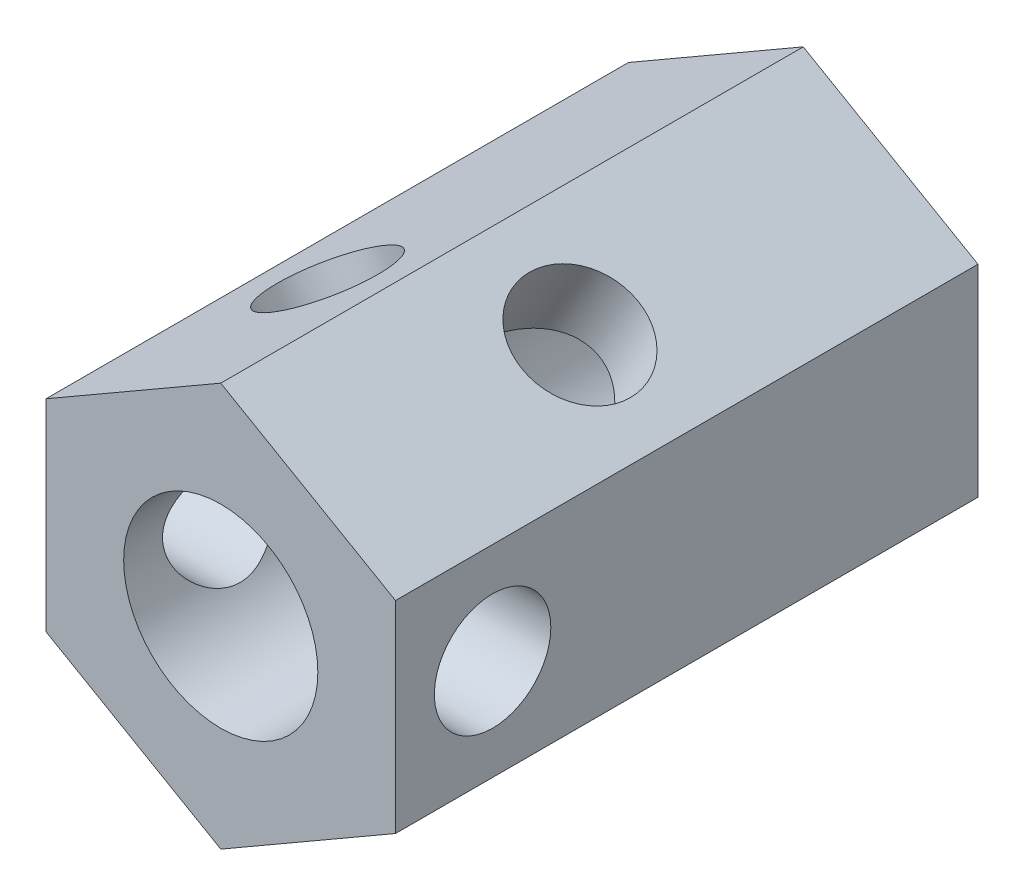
ISO-10303-21;
HEADER;
FILE_DESCRIPTION(('STEP AP214'),'2;1');
FILE_NAME('part.step','',(''),(''),'','','');
FILE_SCHEMA(('AUTOMOTIVE_DESIGN { 1 0 10303 214 1 1 1 1 }'));
ENDSEC;
DATA;
#1=APPLICATION_CONTEXT('core data for automotive mechanical design processes');
#2=APPLICATION_PROTOCOL_DEFINITION('international standard','automotive_design',2000,#1);
#3=PRODUCT_CONTEXT('',#1,'mechanical');
#4=PRODUCT('Part','Part','',(#3));
#5=PRODUCT_RELATED_PRODUCT_CATEGORY('part','',(#4));
#6=PRODUCT_DEFINITION_FORMATION('','',#4);
#7=PRODUCT_DEFINITION_CONTEXT('part definition',#1,'design');
#8=PRODUCT_DEFINITION('design','',#6,#7);
#9=PRODUCT_DEFINITION_SHAPE('','',#8);
#10=(LENGTH_UNIT() NAMED_UNIT(*) SI_UNIT(.MILLI.,.METRE.));
#11=(NAMED_UNIT(*) PLANE_ANGLE_UNIT() SI_UNIT($,.RADIAN.));
#12=(NAMED_UNIT(*) SI_UNIT($,.STERADIAN.) SOLID_ANGLE_UNIT());
#13=UNCERTAINTY_MEASURE_WITH_UNIT(LENGTH_MEASURE(1.E-05),#10,'distance_accuracy_value','');
#14=(GEOMETRIC_REPRESENTATION_CONTEXT(3) GLOBAL_UNCERTAINTY_ASSIGNED_CONTEXT((#13)) GLOBAL_UNIT_ASSIGNED_CONTEXT((#10,
#11,#12)) REPRESENTATION_CONTEXT('',''));
#15=CARTESIAN_POINT('',(0.,0.,0.));
#16=DIRECTION('',(0.,0.,1.));
#17=DIRECTION('',(1.,0.,0.));
#18=AXIS2_PLACEMENT_3D('',#15,#16,#17);
#19=CARTESIAN_POINT('',(-18.,10.4076951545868,60.));
#20=DIRECTION('',(0.,0.,1.));
#21=DIRECTION('',(1.,0.,0.));
#22=AXIS2_PLACEMENT_3D('',#19,#20,#21);
#23=PLANE('',#22);
#24=CARTESIAN_POINT('',(0.,0.,60.));
#25=DIRECTION('',(0.,0.,1.));
#26=DIRECTION('',(1.,0.,0.));
#27=AXIS2_PLACEMENT_3D('',#24,#25,#26);
#28=CIRCLE('',#27,10.);
#29=CARTESIAN_POINT('',(10.,0.,60.));
#30=VERTEX_POINT('',#29);
#31=EDGE_CURVE('E137',#30,#30,#28,.T.);
#32=ORIENTED_EDGE('',*,*,#31,.F.);
#33=EDGE_LOOP('',(#32));
#34=FACE_BOUND('',#33,.T.);
#35=DIRECTION('',(0.866025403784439,-0.5,0.));
#36=VECTOR('',#35,1.);
#37=CARTESIAN_POINT('',(-18.,-10.3923048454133,60.));
#38=LINE('',#37,#36);
#39=CARTESIAN_POINT('',(-18.,-10.3923048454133,60.));
#40=VERTEX_POINT('',#39);
#41=CARTESIAN_POINT('',(0.,-20.7846096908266,60.));
#42=VERTEX_POINT('',#41);
#43=EDGE_CURVE('E107',#40,#42,#38,.T.);
#44=ORIENTED_EDGE('',*,*,#43,.T.);
#45=DIRECTION('',(0.866025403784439,0.5,0.));
#46=VECTOR('',#45,1.);
#47=CARTESIAN_POINT('',(0.,-20.7846096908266,60.));
#48=LINE('',#47,#46);
#49=CARTESIAN_POINT('',(18.,-10.3923048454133,60.));
#50=VERTEX_POINT('',#49);
#51=EDGE_CURVE('E80',#42,#50,#48,.T.);
#52=ORIENTED_EDGE('',*,*,#51,.T.);
#53=DIRECTION('',(0.,-1.,0.));
#54=VECTOR('',#53,1.);
#55=CARTESIAN_POINT('',(18.,10.4076951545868,60.));
#56=LINE('',#55,#54);
#57=CARTESIAN_POINT('',(18.,10.3923048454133,60.));
#58=VERTEX_POINT('',#57);
#59=EDGE_CURVE('E28',#58,#50,#56,.T.);
#60=ORIENTED_EDGE('',*,*,#59,.F.);
#61=DIRECTION('',(-0.866025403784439,0.5,0.));
#62=VECTOR('',#61,1.);
#63=CARTESIAN_POINT('',(18.,10.3923048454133,60.));
#64=LINE('',#63,#62);
#65=CARTESIAN_POINT('',(0.,20.7846096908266,60.));
#66=VERTEX_POINT('',#65);
#67=EDGE_CURVE('E101',#58,#66,#64,.T.);
#68=ORIENTED_EDGE('',*,*,#67,.T.);
#69=DIRECTION('',(-0.866025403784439,-0.5,0.));
#70=VECTOR('',#69,1.);
#71=CARTESIAN_POINT('',(0.,20.7846096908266,60.));
#72=LINE('',#71,#70);
#73=CARTESIAN_POINT('',(-18.,10.3923048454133,60.));
#74=VERTEX_POINT('',#73);
#75=EDGE_CURVE('E104',#66,#74,#72,.T.);
#76=ORIENTED_EDGE('',*,*,#75,.T.);
#77=DIRECTION('',(0.,-1.,0.));
#78=VECTOR('',#77,1.);
#79=CARTESIAN_POINT('',(-18.,10.4076951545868,60.));
#80=LINE('',#79,#78);
#81=EDGE_CURVE('E9',#74,#40,#80,.T.);
#82=ORIENTED_EDGE('',*,*,#81,.T.);
#83=EDGE_LOOP('',(#44,#52,#60,#68,#76,#82));
#84=FACE_BOUND('',#83,.T.);
#85=ADVANCED_FACE('F14',(#34,#84),#23,.T.);
#86=CARTESIAN_POINT('',(9.49333580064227,16.4429399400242,32.));
#87=DIRECTION('',(-0.500000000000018,-0.866025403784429,0.));
#88=DIRECTION('',(0.866025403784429,-0.500000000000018,0.));
#89=AXIS2_PLACEMENT_3D('',#86,#87,#88);
#90=CYLINDRICAL_SURFACE('',#89,6.);
#91=CARTESIAN_POINT('',(9.19615242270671,3.9282032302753,32.));
#92=CARTESIAN_POINT('',(9.19615251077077,3.92820161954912,32.1509543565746));
#93=CARTESIAN_POINT('',(9.19335567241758,3.93476967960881,32.3018983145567));
#94=CARTESIAN_POINT('',(9.18216455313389,3.96081493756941,32.602444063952));
#95=CARTESIAN_POINT('',(9.17377064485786,3.98029127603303,32.7520459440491));
#96=CARTESIAN_POINT('',(9.15135771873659,4.03155435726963,33.0487981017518));
#97=CARTESIAN_POINT('',(9.13733474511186,4.06334975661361,33.1959465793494));
#98=CARTESIAN_POINT('',(9.10362716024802,4.13831524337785,33.4866780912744));
#99=CARTESIAN_POINT('',(9.08393986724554,4.18149071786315,33.6302594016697));
#100=CARTESIAN_POINT('',(9.01662510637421,4.3257023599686,34.0521394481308));
#101=CARTESIAN_POINT('',(8.96056008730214,4.44188549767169,34.3240692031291));
#102=CARTESIAN_POINT('',(8.82509048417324,4.70527984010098,34.8457959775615));
#103=CARTESIAN_POINT('',(8.74567893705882,4.85250029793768,35.0955863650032));
#104=CARTESIAN_POINT('',(8.55087661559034,5.18889606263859,35.5998079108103));
#105=CARTESIAN_POINT('',(8.43227389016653,5.38100023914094,35.8510722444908));
#106=CARTESIAN_POINT('',(8.22958233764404,5.68231731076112,36.202012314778));
#107=CARTESIAN_POINT('',(8.15782858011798,5.78502597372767,36.3147357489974));
#108=CARTESIAN_POINT('',(8.00574732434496,5.99371818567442,36.5311141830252));
#109=CARTESIAN_POINT('',(7.92541825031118,6.09970233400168,36.634767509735));
#110=CARTESIAN_POINT('',(7.74682071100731,6.32531861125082,36.8431024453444));
#111=CARTESIAN_POINT('',(7.6475514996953,6.44518431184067,36.9466763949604));
#112=CARTESIAN_POINT('',(7.43816507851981,6.68573931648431,37.1409905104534));
#113=CARTESIAN_POINT('',(7.32805275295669,6.8064282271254,37.231736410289));
#114=CARTESIAN_POINT('',(7.09704162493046,7.04697035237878,37.399438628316));
#115=CARTESIAN_POINT('',(6.97614748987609,7.16682390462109,37.4764008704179));
#116=CARTESIAN_POINT('',(6.7238601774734,7.40403021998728,37.615559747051));
#117=CARTESIAN_POINT('',(6.59246873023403,7.52138339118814,37.6777588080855));
#118=CARTESIAN_POINT('',(6.33285437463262,7.74086778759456,37.7812406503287));
#119=CARTESIAN_POINT('',(6.20552532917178,7.84338302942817,37.8239528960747));
#120=CARTESIAN_POINT('',(5.9435558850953,8.04371317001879,37.8958855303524));
#121=CARTESIAN_POINT('',(5.808915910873,8.14152834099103,37.9251067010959));
#122=CARTESIAN_POINT('',(5.53343719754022,8.33120749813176,37.9695703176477));
#123=CARTESIAN_POINT('',(5.39260340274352,8.42307609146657,37.9848237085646));
#124=CARTESIAN_POINT('',(5.10587546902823,8.59990664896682,38.0011292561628));
#125=CARTESIAN_POINT('',(4.95998184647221,8.68486931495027,38.0021828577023));
#126=CARTESIAN_POINT('',(4.68292900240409,8.83696576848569,37.9908321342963));
#127=CARTESIAN_POINT('',(4.55219356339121,8.90500279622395,37.9800850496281));
#128=CARTESIAN_POINT('',(4.28887688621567,9.0347707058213,37.9478341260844));
#129=CARTESIAN_POINT('',(4.15629506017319,9.09649952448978,37.9263267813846));
#130=CARTESIAN_POINT('',(3.89040327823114,9.21335153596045,37.8728332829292));
#131=CARTESIAN_POINT('',(3.75709359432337,9.26847704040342,37.8408508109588));
#132=CARTESIAN_POINT('',(3.49064907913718,9.37207622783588,37.7667682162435));
#133=CARTESIAN_POINT('',(3.35751433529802,9.42054733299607,37.7246641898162));
#134=CARTESIAN_POINT('',(3.09170613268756,9.51110753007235,37.6305392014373));
#135=CARTESIAN_POINT('',(2.95903893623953,9.55316115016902,37.5784664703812));
#136=CARTESIAN_POINT('',(2.6957641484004,9.63076967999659,37.4650477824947));
#137=CARTESIAN_POINT('',(2.56515730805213,9.66632226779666,37.403698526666));
#138=CARTESIAN_POINT('',(2.17774952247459,9.76361293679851,37.2065161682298));
#139=CARTESIAN_POINT('',(1.92518078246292,9.81604399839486,37.0574840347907));
#140=CARTESIAN_POINT('',(1.40846141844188,9.9041926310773,36.7086348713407));
#141=CARTESIAN_POINT('',(1.14653082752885,9.93716581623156,36.5048780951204));
#142=CARTESIAN_POINT('',(0.651316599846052,9.98186389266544,36.0623521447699));
#143=CARTESIAN_POINT('',(0.418072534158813,9.99355973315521,35.8235355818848));
#144=CARTESIAN_POINT('',(0.0833799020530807,10.0003752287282,35.4272794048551));
#145=CARTESIAN_POINT('',(-0.0307866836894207,10.0005339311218,35.2804716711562));
#146=CARTESIAN_POINT('',(-0.24624719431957,9.99754728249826,34.9776206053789));
#147=CARTESIAN_POINT('',(-0.347539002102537,9.99440138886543,34.8215757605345));
#148=CARTESIAN_POINT('',(-0.535402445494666,9.98609946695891,34.5012170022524));
#149=CARTESIAN_POINT('',(-0.621996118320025,9.98094648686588,34.3369159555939));
#150=CARTESIAN_POINT('',(-0.778844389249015,9.96993434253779,34.0007266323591));
#151=CARTESIAN_POINT('',(-0.84910540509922,9.96407545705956,33.8288413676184));
#152=CARTESIAN_POINT('',(-0.956326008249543,9.95427415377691,33.5221067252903));
#153=CARTESIAN_POINT('',(-0.997223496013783,9.95021648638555,33.3886289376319));
#154=CARTESIAN_POINT('',(-1.06804295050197,9.94286458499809,33.1187811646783));
#155=CARTESIAN_POINT('',(-1.097967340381,9.93957018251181,32.9824118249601));
#156=CARTESIAN_POINT('',(-1.14623068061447,9.93412034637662,32.7077432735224));
#157=CARTESIAN_POINT('',(-1.16458075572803,9.93196381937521,32.5694460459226));
#158=CARTESIAN_POINT('',(-1.1893460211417,9.92902882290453,32.2917632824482));
#159=CARTESIAN_POINT('',(-1.19576095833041,9.92825038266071,32.1523777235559));
#160=CARTESIAN_POINT('',(-1.19650957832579,9.92816021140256,31.8733812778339));
#161=CARTESIAN_POINT('',(-1.19082663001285,9.92885049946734,31.733770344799));
#162=CARTESIAN_POINT('',(-1.16747627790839,9.93162299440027,31.4555749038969));
#163=CARTESIAN_POINT('',(-1.14980881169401,9.93370520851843,31.3169904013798));
#164=CARTESIAN_POINT('',(-1.10285776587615,9.93902719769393,31.0417603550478));
#165=CARTESIAN_POINT('',(-1.0735685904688,9.94226753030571,30.9051157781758));
#166=CARTESIAN_POINT('',(-1.00396432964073,9.94953623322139,30.6346669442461));
#167=CARTESIAN_POINT('',(-0.963644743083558,9.95356492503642,30.5008638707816));
#168=CARTESIAN_POINT('',(-0.827332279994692,9.96613677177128,30.1052987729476));
#169=CARTESIAN_POINT('',(-0.715872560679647,9.97518178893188,29.8487461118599));
#170=CARTESIAN_POINT('',(-0.458046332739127,9.99033634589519,29.3540524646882));
#171=CARTESIAN_POINT('',(-0.311666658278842,9.99644477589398,29.1159184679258));
#172=CARTESIAN_POINT('',(0.0394718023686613,10.0017230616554,28.6190272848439));
#173=CARTESIAN_POINT('',(0.249997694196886,9.99944352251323,28.3642915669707));
#174=CARTESIAN_POINT('',(0.590200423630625,9.98321821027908,28.0062804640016));
#175=CARTESIAN_POINT('',(0.70777177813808,9.97566451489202,27.8908780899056));
#176=CARTESIAN_POINT('',(0.950277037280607,9.95548884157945,27.6684568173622));
#177=CARTESIAN_POINT('',(1.07521224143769,9.94286596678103,27.5614394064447));
#178=CARTESIAN_POINT('',(1.3482570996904,9.90976812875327,27.3429474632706));
#179=CARTESIAN_POINT('',(1.49726363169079,9.8884835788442,27.2327130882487));
#180=CARTESIAN_POINT('',(1.80216817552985,9.83748280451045,27.0245106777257));
#181=CARTESIAN_POINT('',(1.95806336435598,9.80777000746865,26.9265376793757));
#182=CARTESIAN_POINT('',(2.27539200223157,9.73904189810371,26.743747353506));
#183=CARTESIAN_POINT('',(2.43682419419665,9.70002868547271,26.6589270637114));
#184=CARTESIAN_POINT('',(2.76372194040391,9.6119965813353,26.503418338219));
#185=CARTESIAN_POINT('',(2.92918694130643,9.56297905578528,26.4327279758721));
#186=CARTESIAN_POINT('',(3.25034645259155,9.45841753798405,26.3110581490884));
#187=CARTESIAN_POINT('',(3.40587806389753,9.40360583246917,26.2590201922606));
#188=CARTESIAN_POINT('',(3.71745882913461,9.28484170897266,26.1686898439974));
#189=CARTESIAN_POINT('',(3.8735079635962,9.22088963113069,26.130396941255));
#190=CARTESIAN_POINT('',(4.18437694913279,9.08404114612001,26.068198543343));
#191=CARTESIAN_POINT('',(4.33919782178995,9.01115324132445,26.0442794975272));
#192=CARTESIAN_POINT('',(4.64611522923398,8.85681109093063,26.0111901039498));
#193=CARTESIAN_POINT('',(4.79821211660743,8.77535796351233,26.002017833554));
#194=CARTESIAN_POINT('',(5.07805900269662,8.61601328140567,25.9988073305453));
#195=CARTESIAN_POINT('',(5.20634838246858,8.53909818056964,26.0029120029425));
#196=CARTESIAN_POINT('',(5.45874980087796,8.37999401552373,26.022250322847));
#197=CARTESIAN_POINT('',(5.58286194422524,8.29780508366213,26.037483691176));
#198=CARTESIAN_POINT('',(5.82606089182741,8.12889512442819,26.0788768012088));
#199=CARTESIAN_POINT('',(5.94514794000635,8.04217431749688,26.105036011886));
#200=CARTESIAN_POINT('',(6.17761434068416,7.86501382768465,26.1679506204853));
#201=CARTESIAN_POINT('',(6.29099352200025,7.77457403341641,26.2047063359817));
#202=CARTESIAN_POINT('',(6.50970955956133,7.59233867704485,26.2877086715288));
#203=CARTESIAN_POINT('',(6.61514738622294,7.50058924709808,26.3337908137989));
#204=CARTESIAN_POINT('',(6.81963790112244,7.31516400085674,26.4353336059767));
#205=CARTESIAN_POINT('',(6.91868850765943,7.22148756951,26.4907972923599));
#206=CARTESIAN_POINT('',(7.20582702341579,6.93887614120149,26.6705139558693));
#207=CARTESIAN_POINT('',(7.38405479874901,6.74822969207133,26.8081516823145));
#208=CARTESIAN_POINT('',(7.73122105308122,6.34868635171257,27.131708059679));
#209=CARTESIAN_POINT('',(7.8970505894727,6.14005502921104,27.3212460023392));
#210=CARTESIAN_POINT('',(8.19670880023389,5.73390423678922,27.7350410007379));
#211=CARTESIAN_POINT('',(8.33050159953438,5.53639741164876,27.9593365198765));
#212=CARTESIAN_POINT('',(8.51582284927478,5.24370385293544,28.3340942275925));
#213=CARTESIAN_POINT('',(8.57777967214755,5.14146180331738,28.4740909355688));
#214=CARTESIAN_POINT('',(8.69240473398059,4.94519921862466,28.7634621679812));
#215=CARTESIAN_POINT('',(8.74507069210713,4.85118070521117,28.9128389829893));
#216=CARTESIAN_POINT('',(8.84138106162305,4.673351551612,29.2203071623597));
#217=CARTESIAN_POINT('',(8.88502661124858,4.58953962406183,29.378397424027));
#218=CARTESIAN_POINT('',(8.96354722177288,4.43422966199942,29.7025090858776));
#219=CARTESIAN_POINT('',(8.99842818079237,4.36272335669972,29.8685250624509));
#220=CARTESIAN_POINT('',(9.05705465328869,4.23957720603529,30.1932108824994));
#221=CARTESIAN_POINT('',(9.08149344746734,4.18676714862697,30.351310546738));
#222=CARTESIAN_POINT('',(9.12330933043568,4.09484838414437,30.6722735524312));
#223=CARTESIAN_POINT('',(9.14069101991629,4.05573075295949,30.8351337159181));
#224=CARTESIAN_POINT('',(9.16845201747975,3.99257846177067,31.1640903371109));
#225=CARTESIAN_POINT('',(9.17884236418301,3.96852002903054,31.3301812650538));
#226=CARTESIAN_POINT('',(9.1926920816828,3.93633431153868,31.6641859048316));
#227=CARTESIAN_POINT('',(9.1961523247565,3.92820502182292,31.8320993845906));
#228=CARTESIAN_POINT('',(9.19615242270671,3.9282032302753,32.));
#229=B_SPLINE_CURVE_WITH_KNOTS('',3,(#91,#92,#93,#94,#95,#96,#97,#98,#99,#100,#101,#102,#103,
#104,#105,#106,#107,#108,#109,#110,#111,#112,#113,#114,#115,#116,#117,#118,#119,#120,#121,#122,
#123,#124,#125,#126,#127,#128,#129,#130,#131,#132,#133,#134,#135,#136,#137,#138,#139,#140,#141,
#142,#143,#144,#145,#146,#147,#148,#149,#150,#151,#152,#153,#154,#155,#156,#157,#158,#159,#160,
#161,#162,#163,#164,#165,#166,#167,#168,#169,#170,#171,#172,#173,#174,#175,#176,#177,#178,#179,
#180,#181,#182,#183,#184,#185,#186,#187,#188,#189,#190,#191,#192,#193,#194,#195,#196,#197,#198,
#199,#200,#201,#202,#203,#204,#205,#206,#207,#208,#209,#210,#211,#212,#213,#214,#215,#216,#217,
#218,#219,#220,#221,#222,#223,#224,#225,#226,#227,#228),.UNSPECIFIED.,.T.,.F.,(4,2,2,2,2,2,2,2,
2,2,2,2,2,2,2,2,2,2,2,2,2,2,2,2,2,2,2,2,2,2,2,2,2,2,2,2,2,2,2,2,2,2,2,2,2,2,2,2,2,2,2,2,2,2,2,2,
2,2,2,2,2,2,2,2,2,2,2,2,4),(0.,0.452678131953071,0.90532612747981,1.35829277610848,
1.81147423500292,2.71030243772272,3.60939898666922,4.61842643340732,5.12364477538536,
5.62895611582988,6.18907007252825,6.7489328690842,7.30855446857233,7.86808402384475,
8.37422610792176,8.88033884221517,9.38605464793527,9.89171899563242,10.3345024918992,
10.777430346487,11.2202026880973,11.6631460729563,12.1084553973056,12.5539234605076,
13.4442631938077,14.4409496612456,15.4389959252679,15.9963343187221,16.5537642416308,
17.1103508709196,17.6667184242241,18.0852817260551,18.5037525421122,18.9218205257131,
19.3398973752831,19.7585493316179,20.1772034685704,20.5960594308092,21.0150865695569,
21.8512278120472,22.6876848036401,23.6749363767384,24.1693355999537,24.6638223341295,
25.2228243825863,25.7815994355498,26.3402484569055,26.8988212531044,27.4168373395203,
27.9348341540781,28.4523418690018,28.9697821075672,29.4181370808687,29.8664808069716,
30.3148027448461,30.7631381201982,31.2041651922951,31.6453352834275,32.5270550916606,
33.5044950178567,34.4830244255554,35.0347612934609,35.5866334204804,36.1384358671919,
36.6898659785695,37.1945532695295,37.6989110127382,38.2024705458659,38.7059666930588),.UNSPECIFIED.);
#230=CARTESIAN_POINT('',(9.19615242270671,3.9282032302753,32.));
#231=VERTEX_POINT('',#230);
#232=EDGE_CURVE('E148',#231,#231,#229,.T.);
#233=ORIENTED_EDGE('',*,*,#232,.T.);
#234=EDGE_LOOP('',(#233));
#235=FACE_BOUND('',#234,.T.);
#236=CARTESIAN_POINT('',(9.00000000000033,15.5884572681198,32.));
#237=DIRECTION('',(0.5,0.866025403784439,0.));
#238=DIRECTION('',(-0.866025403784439,0.5,0.));
#239=AXIS2_PLACEMENT_3D('',#236,#237,#238);
#240=CIRCLE('',#239,6.);
#241=CARTESIAN_POINT('',(3.8038475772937,18.5884572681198,32.));
#242=VERTEX_POINT('',#241);
#243=EDGE_CURVE('E125',#242,#242,#240,.T.);
#244=ORIENTED_EDGE('',*,*,#243,.T.);
#245=EDGE_LOOP('',(#244));
#246=FACE_BOUND('',#245,.T.);
#247=ADVANCED_FACE('F153',(#235,#246),#90,.F.);
#248=CARTESIAN_POINT('',(1.19615242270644,-9.92820323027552,32.));
#249=CARTESIAN_POINT('',(1.19615386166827,-9.92820250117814,31.8490456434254));
#250=CARTESIAN_POINT('',(1.18906733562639,-9.92906439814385,31.6981016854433));
#251=CARTESIAN_POINT('',(1.16091592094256,-9.93239523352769,31.397555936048));
#252=CARTESIAN_POINT('',(1.13985196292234,-9.93486406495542,31.2479540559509));
#253=CARTESIAN_POINT('',(1.08425036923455,-9.94108544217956,30.9512018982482));
#254=CARTESIAN_POINT('',(1.04970325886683,-9.94483889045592,30.8040534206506));
#255=CARTESIAN_POINT('',(0.967927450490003,-9.95313000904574,30.5133219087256));
#256=CARTESIAN_POINT('',(0.920692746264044,-9.95766805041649,30.3697405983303));
#257=CARTESIAN_POINT('',(0.762144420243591,-9.97147757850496,29.9478605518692));
#258=CARTESIAN_POINT('',(0.633494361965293,-9.98101541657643,29.6759307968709));
#259=CARTESIAN_POINT('',(0.337653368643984,-9.99539247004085,29.1542040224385));
#260=CARTESIAN_POINT('',(0.170450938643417,-10.0002302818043,28.9044136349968));
#261=CARTESIAN_POINT('',(-0.218277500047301,-9.99972440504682,28.4001920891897));
#262=CARTESIAN_POINT('',(-0.44394595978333,-9.99306352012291,28.1489277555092));
#263=CARTESIAN_POINT('',(-0.806239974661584,-9.96818602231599,27.797987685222));
#264=CARTESIAN_POINT('',(-0.931065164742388,-9.9573997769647,27.6852642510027));
#265=CARTESIAN_POINT('',(-1.18783854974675,-9.9300396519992,27.4688858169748));
#266=CARTESIAN_POINT('',(-1.3197880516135,-9.91346470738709,27.365232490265));
#267=CARTESIAN_POINT('',(-1.60447624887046,-9.8716028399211,27.1568975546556));
#268=CARTESIAN_POINT('',(-1.75791759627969,-9.84556603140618,27.0533236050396));
#269=CARTESIAN_POINT('',(-2.07093755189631,-9.7845095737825,26.8590094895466));
#270=CARTESIAN_POINT('',(-2.23051337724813,-9.7494939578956,26.768263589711));
#271=CARTESIAN_POINT('',(-2.55433453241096,-9.66970351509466,26.600561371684));
#272=CARTESIAN_POINT('',(-2.71857782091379,-9.62493289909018,26.5235991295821));
#273=CARTESIAN_POINT('',(-3.05014817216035,-9.52504883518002,26.384440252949));
#274=CARTESIAN_POINT('',(-3.21747472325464,-9.46993708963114,26.3222411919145));
#275=CARTESIAN_POINT('',(-3.5373609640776,-9.3548466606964,26.2187593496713));
#276=CARTESIAN_POINT('',(-3.68980629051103,-9.29583409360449,26.1760471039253));
#277=CARTESIAN_POINT('',(-3.99428200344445,-9.16912697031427,26.1041144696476));
#278=CARTESIAN_POINT('',(-4.14631241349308,-9.10143291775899,26.0748932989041));
#279=CARTESIAN_POINT('',(-4.44831873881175,-8.9577009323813,26.0304296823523));
#280=CARTESIAN_POINT('',(-4.59829617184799,-8.88166958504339,26.0151762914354));
#281=CARTESIAN_POINT('',(-4.89479989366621,-8.72177118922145,25.9988707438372));
#282=CARTESIAN_POINT('',(-5.04132653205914,-8.63790493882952,25.9978171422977));
#283=CARTESIAN_POINT('',(-5.31157234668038,-8.4740183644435,26.0091678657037));
#284=CARTESIAN_POINT('',(-5.43586186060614,-8.39481666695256,26.0199149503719));
#285=CARTESIAN_POINT('',(-5.6799025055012,-8.23166169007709,26.0521658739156));
#286=CARTESIAN_POINT('',(-5.79965214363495,-8.14770686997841,26.0736732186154));
#287=CARTESIAN_POINT('',(-6.03379484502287,-7.97586383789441,26.1271667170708));
#288=CARTESIAN_POINT('',(-6.1481897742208,-7.88797701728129,26.1591491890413));
#289=CARTESIAN_POINT('',(-6.37113155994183,-7.70902889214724,26.2332317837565));
#290=CARTESIAN_POINT('',(-6.47967614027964,-7.61796637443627,26.2753358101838));
#291=CARTESIAN_POINT('',(-6.69100767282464,-7.43304981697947,26.3694607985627));
#292=CARTESIAN_POINT('',(-6.79376077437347,-7.33918346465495,26.4215335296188));
#293=CARTESIAN_POINT('',(-6.99260912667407,-7.14998507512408,26.5349522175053));
#294=CARTESIAN_POINT('',(-7.08870199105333,-7.0546525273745,26.596301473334));
#295=CARTESIAN_POINT('',(-7.36666207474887,-6.76779287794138,26.7934838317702));
#296=CARTESIAN_POINT('',(-7.53835307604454,-6.57527746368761,26.9425159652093));
#297=CARTESIAN_POINT('',(-7.87305171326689,-6.17185968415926,27.2913651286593));
#298=CARTESIAN_POINT('',(-8.03257262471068,-5.96150773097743,27.4951219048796));
#299=CARTESIAN_POINT('',(-8.31888940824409,-5.55498866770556,27.9376478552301));
#300=CARTESIAN_POINT('',(-8.44564033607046,-5.35884130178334,28.1764644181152));
#301=CARTESIAN_POINT('',(-8.61888904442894,-5.0723967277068,28.5727205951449));
#302=CARTESIAN_POINT('',(-8.67610977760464,-4.97360491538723,28.7195283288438));
#303=CARTESIAN_POINT('',(-8.78125351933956,-4.78551731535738,29.0223793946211));
#304=CARTESIAN_POINT('',(-8.8291749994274,-4.69622308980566,29.1784242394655));
#305=CARTESIAN_POINT('',(-8.91591704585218,-4.52937761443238,29.4987829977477));
#306=CARTESIAN_POINT('',(-8.95475127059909,-4.4518088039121,29.6630840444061));
#307=CARTESIAN_POINT('',(-9.02363860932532,-4.31046814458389,29.999273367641));
#308=CARTESIAN_POINT('',(-9.05369517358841,-4.24669087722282,30.1711586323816));
#309=CARTESIAN_POINT('',(-9.09881729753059,-4.14893445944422,30.4778932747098));
#310=CARTESIAN_POINT('',(-9.11575199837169,-4.11148736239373,30.6113710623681));
#311=CARTESIAN_POINT('',(-9.14479479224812,-4.04647996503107,30.8812188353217));
#312=CARTESIAN_POINT('',(-9.15690395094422,-4.01891748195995,31.0175881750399));
#313=CARTESIAN_POINT('',(-9.17631592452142,-3.97439528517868,31.2922567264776));
#314=CARTESIAN_POINT('',(-9.18362335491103,-3.95742539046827,31.4305539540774));
#315=CARTESIAN_POINT('',(-9.19346420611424,-3.93451054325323,31.7082367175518));
#316=CARTESIAN_POINT('',(-9.19599752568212,-3.92856582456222,31.8476222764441));
#317=CARTESIAN_POINT('',(-9.19629374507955,-3.92787241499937,32.1266187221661));
#318=CARTESIAN_POINT('',(-9.19405007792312,-3.93313913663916,32.266229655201));
#319=CARTESIAN_POINT('',(-9.18477595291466,-3.95474738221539,32.5444250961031));
#320=CARTESIAN_POINT('',(-9.17774547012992,-3.97108896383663,32.6830095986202));
#321=CARTESIAN_POINT('',(-9.15887892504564,-4.0144107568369,32.9582396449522));
#322=CARTESIAN_POINT('',(-9.14704054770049,-4.04139609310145,33.0948842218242));
#323=CARTESIAN_POINT('',(-9.11853329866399,-4.10530950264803,33.365333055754));
#324=CARTESIAN_POINT('',(-9.10186245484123,-4.14224163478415,33.4991361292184));
#325=CARTESIAN_POINT('',(-9.04459376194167,-4.26657761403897,33.8947012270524));
#326=CARTESIAN_POINT('',(-8.99669711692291,-4.36762707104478,34.1512538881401));
#327=CARTESIAN_POINT('',(-8.88090823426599,-4.59848841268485,34.6459475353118));
#328=CARTESIAN_POINT('',(-8.81300845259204,-4.72831114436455,34.8840815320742));
#329=CARTESIAN_POINT('',(-8.64201035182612,-5.03504511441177,35.3809727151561));
#330=CARTESIAN_POINT('',(-8.53477326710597,-5.2162261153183,35.6357084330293));
#331=CARTESIAN_POINT('',(-8.35062036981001,-5.50273766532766,35.9937195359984));
#332=CARTESIAN_POINT('',(-8.28529300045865,-5.60078059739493,36.1091219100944));
#333=CARTESIAN_POINT('',(-8.14656772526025,-5.80070847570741,36.3315431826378));
#334=CARTESIAN_POINT('',(-8.07316839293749,-5.90259409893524,36.4385605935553));
#335=CARTESIAN_POINT('',(-7.90798239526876,-6.12250896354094,36.6570525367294));
#336=CARTESIAN_POINT('',(-7.81504616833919,-6.24091013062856,36.7672869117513));
#337=CARTESIAN_POINT('',(-7.61842593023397,-6.47946482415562,36.9754893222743));
#338=CARTESIAN_POINT('',(-7.51474629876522,-6.59961761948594,37.0734623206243));
#339=CARTESIAN_POINT('',(-7.29656169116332,-6.84006822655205,37.256252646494));
#340=CARTESIAN_POINT('',(-7.18205916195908,-6.96036599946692,37.3410729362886));
#341=CARTESIAN_POINT('',(-6.94237225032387,-7.19945170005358,37.4965816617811));
#342=CARTESIAN_POINT('',(-6.81718932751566,-7.31823983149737,37.567272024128));
#343=CARTESIAN_POINT('',(-6.56605664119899,-7.54409136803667,37.6889418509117));
#344=CARTESIAN_POINT('',(-6.44082250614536,-7.65137984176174,37.7409798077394));
#345=CARTESIAN_POINT('',(-6.18217937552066,-7.86183463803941,37.8313101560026));
#346=CARTESIAN_POINT('',(-6.04877068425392,-7.96500111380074,37.869603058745));
#347=CARTESIAN_POINT('',(-5.77482192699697,-8.1657973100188,37.931801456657));
#348=CARTESIAN_POINT('',(-5.63428871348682,-8.26343216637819,37.9557205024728));
#349=CARTESIAN_POINT('',(-5.34716578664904,-8.45205936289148,37.9888098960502));
#350=CARTESIAN_POINT('',(-5.20057686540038,-8.54305256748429,37.997982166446));
#351=CARTESIAN_POINT('',(-4.92265687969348,-8.70573473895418,38.0011926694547));
#352=CARTESIAN_POINT('',(-4.79190175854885,-8.77837905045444,37.9970879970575));
#353=CARTESIAN_POINT('',(-4.52791280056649,-8.91741300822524,37.977749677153));
#354=CARTESIAN_POINT('',(-4.3946790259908,-8.98380281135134,37.962516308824));
#355=CARTESIAN_POINT('',(-4.12679923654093,-9.10996429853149,37.9211231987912));
#356=CARTESIAN_POINT('',(-3.99215329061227,-9.1697363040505,37.894963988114));
#357=CARTESIAN_POINT('',(-3.72249460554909,-9.28247786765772,37.8320493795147));
#358=CARTESIAN_POINT('',(-3.58748185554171,-9.33544722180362,37.7952936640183));
#359=CARTESIAN_POINT('',(-3.3203033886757,-9.43374318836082,37.7122913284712));
#360=CARTESIAN_POINT('',(-3.18812713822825,-9.47918030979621,37.6662091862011));
#361=CARTESIAN_POINT('',(-2.92529890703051,-9.56356166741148,37.5646663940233));
#362=CARTESIAN_POINT('',(-2.79464743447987,-9.60250379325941,37.5092027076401));
#363=CARTESIAN_POINT('',(-2.40632950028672,-9.70986732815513,37.3294860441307));
#364=CARTESIAN_POINT('',(-2.1521109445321,-9.7688938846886,37.1918483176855));
#365=CARTESIAN_POINT('',(-1.63251313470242,-9.86977701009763,36.868291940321));
#366=CARTESIAN_POINT('',(-1.36891834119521,-9.9090739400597,36.6787539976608));
#367=CARTESIAN_POINT('',(-0.867352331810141,-9.96551016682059,36.2649589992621));
#368=CARTESIAN_POINT('',(-0.62941000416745,-9.98262471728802,36.0406634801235));
#369=CARTESIAN_POINT('',(-0.283269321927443,-9.99677084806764,35.6659057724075));
#370=CARTESIAN_POINT('',(-0.163746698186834,-9.99930600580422,35.5259090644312));
#371=CARTESIAN_POINT('',(0.063534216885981,-10.0004429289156,35.2365378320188));
#372=CARTESIAN_POINT('',(0.171289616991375,-9.99904372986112,35.0871610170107));
#373=CARTESIAN_POINT('',(0.373449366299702,-9.99353637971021,34.7796928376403));
#374=CARTESIAN_POINT('',(0.46785539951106,-9.98942857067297,34.621602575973));
#375=CARTESIAN_POINT('',(0.64161807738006,-9.97977443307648,34.2974909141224));
#376=CARTESIAN_POINT('',(0.720984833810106,-9.97422907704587,34.1314749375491));
#377=CARTESIAN_POINT('',(0.856945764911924,-9.96342801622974,33.8067891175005));
#378=CARTESIAN_POINT('',(0.914900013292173,-9.95818760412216,33.648689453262));
#379=CARTESIAN_POINT('',(1.01541193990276,-9.94844183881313,33.3277264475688));
#380=CARTESIAN_POINT('',(1.05797964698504,-9.94393600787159,33.1648662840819));
#381=CARTESIAN_POINT('',(1.12655163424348,-9.93640159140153,32.8359096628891));
#382=CARTESIAN_POINT('',(1.15258202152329,-9.93337067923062,32.6698187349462));
#383=CARTESIAN_POINT('',(1.18738052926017,-9.92927202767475,32.3358140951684));
#384=CARTESIAN_POINT('',(1.19615082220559,-9.92820404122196,32.1679006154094));
#385=CARTESIAN_POINT('',(1.19615242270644,-9.92820323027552,32.));
#386=B_SPLINE_CURVE_WITH_KNOTS('',3,(#248,#249,#250,#251,#252,#253,#254,#255,#256,#257,#258,
#259,#260,#261,#262,#263,#264,#265,#266,#267,#268,#269,#270,#271,#272,#273,#274,#275,#276,#277,
#278,#279,#280,#281,#282,#283,#284,#285,#286,#287,#288,#289,#290,#291,#292,#293,#294,#295,#296,
#297,#298,#299,#300,#301,#302,#303,#304,#305,#306,#307,#308,#309,#310,#311,#312,#313,#314,#315,
#316,#317,#318,#319,#320,#321,#322,#323,#324,#325,#326,#327,#328,#329,#330,#331,#332,#333,#334,
#335,#336,#337,#338,#339,#340,#341,#342,#343,#344,#345,#346,#347,#348,#349,#350,#351,#352,#353,
#354,#355,#356,#357,#358,#359,#360,#361,#362,#363,#364,#365,#366,#367,#368,#369,#370,#371,#372,
#373,#374,#375,#376,#377,#378,#379,#380,#381,#382,#383,#384,#385),.UNSPECIFIED.,.T.,.F.,(4,2,2,
2,2,2,2,2,2,2,2,2,2,2,2,2,2,2,2,2,2,2,2,2,2,2,2,2,2,2,2,2,2,2,2,2,2,2,2,2,2,2,2,2,2,2,2,2,2,2,2,
2,2,2,2,2,2,2,2,2,2,2,2,2,2,2,2,2,4),(0.,0.452678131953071,0.905326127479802,1.35829277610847,
1.81147423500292,2.71030243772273,3.60939898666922,4.61842643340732,5.12364477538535,
5.62895611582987,6.18907007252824,6.7489328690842,7.30855446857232,7.86808402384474,
8.37422610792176,8.88033884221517,9.38605464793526,9.89171899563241,10.3345024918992,
10.777430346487,11.2202026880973,11.6631460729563,12.1084553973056,12.5539234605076,
13.4442631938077,14.4409496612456,15.4389959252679,15.9963343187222,16.5537642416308,
17.1103508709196,17.6667184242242,18.0852817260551,18.5037525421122,18.9218205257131,
19.3398973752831,19.7585493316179,20.1772034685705,20.5960594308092,21.0150865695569,
21.8512278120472,22.6876848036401,23.6749363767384,24.1693355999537,24.6638223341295,
25.2228243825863,25.7815994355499,26.3402484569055,26.8988212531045,27.4168373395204,
27.9348341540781,28.4523418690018,28.9697821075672,29.4181370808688,29.8664808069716,
30.3148027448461,30.7631381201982,31.2041651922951,31.6453352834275,32.5270550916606,
33.5044950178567,34.4830244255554,35.0347612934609,35.5866334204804,36.1384358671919,
36.6898659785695,37.1945532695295,37.6989110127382,38.2024705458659,38.7059666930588),.UNSPECIFIED.);
#387=CARTESIAN_POINT('',(1.19615242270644,-9.92820323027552,32.));
#388=VERTEX_POINT('',#387);
#389=EDGE_CURVE('E141',#388,#388,#386,.T.);
#390=ORIENTED_EDGE('',*,*,#389,.T.);
#391=EDGE_LOOP('',(#390));
#392=FACE_BOUND('',#391,.T.);
#393=CARTESIAN_POINT('',(-9.00000000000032,-15.5884572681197,32.));
#394=DIRECTION('',(-0.5,-0.866025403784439,0.));
#395=DIRECTION('',(0.866025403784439,-0.5,0.));
#396=AXIS2_PLACEMENT_3D('',#393,#394,#395);
#397=CIRCLE('',#396,6.);
#398=CARTESIAN_POINT('',(-3.80384757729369,-18.5884572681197,32.));
#399=VERTEX_POINT('',#398);
#400=EDGE_CURVE('E119',#399,#399,#397,.T.);
#401=ORIENTED_EDGE('',*,*,#400,.T.);
#402=EDGE_LOOP('',(#401));
#403=FACE_BOUND('',#402,.T.);
#404=ADVANCED_FACE('F285',(#392,#403),#90,.F.);
#405=CARTESIAN_POINT('',(9.49333580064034,-16.4429399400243,40.));
#406=DIRECTION('',(-0.49999999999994,0.866025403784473,0.));
#407=DIRECTION('',(-0.866025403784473,-0.49999999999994,0.));
#408=AXIS2_PLACEMENT_3D('',#405,#406,#407);
#409=CYLINDRICAL_SURFACE('',#408,6.);
#410=CARTESIAN_POINT('',(-1.19615242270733,-9.92820323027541,40.));
#411=CARTESIAN_POINT('',(-1.19615386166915,-9.92820250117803,40.1509543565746));
#412=CARTESIAN_POINT('',(-1.18906733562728,-9.92906439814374,40.3018983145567));
#413=CARTESIAN_POINT('',(-1.16091592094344,-9.93239523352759,40.602444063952));
#414=CARTESIAN_POINT('',(-1.13985196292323,-9.93486406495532,40.7520459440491));
#415=CARTESIAN_POINT('',(-1.08425036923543,-9.94108544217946,41.0487981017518));
#416=CARTESIAN_POINT('',(-1.04970325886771,-9.94483889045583,41.1959465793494));
#417=CARTESIAN_POINT('',(-0.967927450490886,-9.95313000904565,41.4866780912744));
#418=CARTESIAN_POINT('',(-0.920692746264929,-9.9576680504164,41.6302594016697));
#419=CARTESIAN_POINT('',(-0.76214442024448,-9.97147757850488,42.0521394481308));
#420=CARTESIAN_POINT('',(-0.633494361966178,-9.98101541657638,42.3240692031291));
#421=CARTESIAN_POINT('',(-0.33765336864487,-9.99539247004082,42.8457959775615));
#422=CARTESIAN_POINT('',(-0.170450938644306,-10.0002302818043,43.0955863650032));
#423=CARTESIAN_POINT('',(0.218277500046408,-9.99972440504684,43.5998079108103));
#424=CARTESIAN_POINT('',(0.443945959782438,-9.99306352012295,43.8510722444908));
#425=CARTESIAN_POINT('',(0.806239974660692,-9.96818602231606,44.202012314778));
#426=CARTESIAN_POINT('',(0.931065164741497,-9.95739977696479,44.3147357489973));
#427=CARTESIAN_POINT('',(1.18783854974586,-9.9300396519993,44.5311141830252));
#428=CARTESIAN_POINT('',(1.31978805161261,-9.9134647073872,44.634767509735));
#429=CARTESIAN_POINT('',(1.60447624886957,-9.87160283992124,44.8431024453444));
#430=CARTESIAN_POINT('',(1.75791759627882,-9.84556603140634,44.9466763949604));
#431=CARTESIAN_POINT('',(2.07093755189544,-9.78450957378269,45.1409905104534));
#432=CARTESIAN_POINT('',(2.23051337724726,-9.74949395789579,45.231736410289));
#433=CARTESIAN_POINT('',(2.5543345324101,-9.66970351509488,45.399438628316));
#434=CARTESIAN_POINT('',(2.71857782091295,-9.62493289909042,45.4764008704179));
#435=CARTESIAN_POINT('',(3.0501481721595,-9.5250488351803,45.615559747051));
#436=CARTESIAN_POINT('',(3.21747472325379,-9.46993708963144,45.6777588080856));
#437=CARTESIAN_POINT('',(3.53736096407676,-9.35484666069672,45.7812406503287));
#438=CARTESIAN_POINT('',(3.6898062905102,-9.29583409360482,45.8239528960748));
#439=CARTESIAN_POINT('',(3.99428200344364,-9.16912697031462,45.8958855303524));
#440=CARTESIAN_POINT('',(4.14631241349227,-9.10143291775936,45.9251067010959));
#441=CARTESIAN_POINT('',(4.44831873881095,-8.9577009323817,45.9695703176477));
#442=CARTESIAN_POINT('',(4.5982961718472,-8.8816695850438,45.9848237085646));
#443=CARTESIAN_POINT('',(4.89479989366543,-8.72177118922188,46.0011292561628));
#444=CARTESIAN_POINT('',(5.04132653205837,-8.63790493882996,46.0021828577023));
#445=CARTESIAN_POINT('',(5.31157234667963,-8.47401836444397,45.9908321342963));
#446=CARTESIAN_POINT('',(5.43586186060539,-8.39481666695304,45.9800850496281));
#447=CARTESIAN_POINT('',(5.67990250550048,-8.2316616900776,45.9478341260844));
#448=CARTESIAN_POINT('',(5.79965214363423,-8.14770686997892,45.9263267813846));
#449=CARTESIAN_POINT('',(6.03379484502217,-7.97586383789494,45.8728332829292));
#450=CARTESIAN_POINT('',(6.1481897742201,-7.88797701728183,45.8408508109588));
#451=CARTESIAN_POINT('',(6.37113155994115,-7.7090288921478,45.7667682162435));
#452=CARTESIAN_POINT('',(6.47967614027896,-7.61796637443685,45.7246641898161));
#453=CARTESIAN_POINT('',(6.69100767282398,-7.43304981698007,45.6305392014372));
#454=CARTESIAN_POINT('',(6.79376077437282,-7.33918346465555,45.5784664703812));
#455=CARTESIAN_POINT('',(6.99260912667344,-7.1499850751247,45.4650477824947));
#456=CARTESIAN_POINT('',(7.08870199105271,-7.05465252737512,45.403698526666));
#457=CARTESIAN_POINT('',(7.36666207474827,-6.76779287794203,45.2065161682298));
#458=CARTESIAN_POINT('',(7.53835307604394,-6.57527746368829,45.0574840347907));
#459=CARTESIAN_POINT('',(7.87305171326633,-6.17185968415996,44.7086348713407));
#460=CARTESIAN_POINT('',(8.03257262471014,-5.96150773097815,44.5048780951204));
#461=CARTESIAN_POINT('',(8.3188894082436,-5.55498866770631,44.0623521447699));
#462=CARTESIAN_POINT('',(8.44564033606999,-5.35884130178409,43.8235355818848));
#463=CARTESIAN_POINT('',(8.61888904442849,-5.07239672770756,43.4272794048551));
#464=CARTESIAN_POINT('',(8.6761097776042,-4.973604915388,43.2804716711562));
#465=CARTESIAN_POINT('',(8.78125351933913,-4.78551731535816,42.9776206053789));
#466=CARTESIAN_POINT('',(8.82917499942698,-4.69622308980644,42.8215757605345));
#467=CARTESIAN_POINT('',(8.91591704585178,-4.52937761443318,42.5012170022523));
#468=CARTESIAN_POINT('',(8.9547512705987,-4.4518088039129,42.3369159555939));
#469=CARTESIAN_POINT('',(9.02363860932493,-4.3104681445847,42.000726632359));
#470=CARTESIAN_POINT('',(9.05369517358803,-4.24669087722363,41.8288413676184));
#471=CARTESIAN_POINT('',(9.09881729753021,-4.14893445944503,41.5221067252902));
#472=CARTESIAN_POINT('',(9.11575199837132,-4.11148736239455,41.3886289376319));
#473=CARTESIAN_POINT('',(9.14479479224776,-4.04647996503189,41.1187811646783));
#474=CARTESIAN_POINT('',(9.15690395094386,-4.01891748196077,40.9824118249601));
#475=CARTESIAN_POINT('',(9.17631592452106,-3.97439528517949,40.7077432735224));
#476=CARTESIAN_POINT('',(9.18362335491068,-3.95742539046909,40.5694460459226));
#477=CARTESIAN_POINT('',(9.19346420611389,-3.93451054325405,40.2917632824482));
#478=CARTESIAN_POINT('',(9.19599752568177,-3.92856582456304,40.1523777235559));
#479=CARTESIAN_POINT('',(9.1962937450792,-3.92787241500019,39.8733812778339));
#480=CARTESIAN_POINT('',(9.19405007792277,-3.93313913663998,39.733770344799));
#481=CARTESIAN_POINT('',(9.18477595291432,-3.95474738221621,39.4555749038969));
#482=CARTESIAN_POINT('',(9.17774547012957,-3.97108896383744,39.3169904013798));
#483=CARTESIAN_POINT('',(9.15887892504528,-4.01441075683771,39.0417603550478));
#484=CARTESIAN_POINT('',(9.14704054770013,-4.04139609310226,38.9051157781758));
#485=CARTESIAN_POINT('',(9.11853329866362,-4.10530950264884,38.6346669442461));
#486=CARTESIAN_POINT('',(9.10186245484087,-4.14224163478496,38.5008638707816));
#487=CARTESIAN_POINT('',(9.0445937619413,-4.26657761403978,38.1052987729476));
#488=CARTESIAN_POINT('',(8.99669711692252,-4.36762707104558,37.8487461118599));
#489=CARTESIAN_POINT('',(8.88090823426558,-4.59848841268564,37.3540524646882));
#490=CARTESIAN_POINT('',(8.81300845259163,-4.72831114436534,37.1159184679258));
#491=CARTESIAN_POINT('',(8.64201035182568,-5.03504511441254,36.6190272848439));
#492=CARTESIAN_POINT('',(8.53477326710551,-5.21622611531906,36.3642915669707));
#493=CARTESIAN_POINT('',(8.35062036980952,-5.5027376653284,36.0062804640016));
#494=CARTESIAN_POINT('',(8.28529300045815,-5.60078059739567,35.8908780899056));
#495=CARTESIAN_POINT('',(8.14656772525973,-5.80070847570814,35.6684568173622));
#496=CARTESIAN_POINT('',(8.07316839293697,-5.90259409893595,35.5614394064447));
#497=CARTESIAN_POINT('',(7.90798239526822,-6.12250896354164,35.3429474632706));
#498=CARTESIAN_POINT('',(7.81504616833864,-6.24091013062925,35.2327130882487));
#499=CARTESIAN_POINT('',(7.61842593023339,-6.4794648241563,35.0245106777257));
#500=CARTESIAN_POINT('',(7.51474629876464,-6.5996176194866,34.9265376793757));
#501=CARTESIAN_POINT('',(7.29656169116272,-6.84006822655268,34.743747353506));
#502=CARTESIAN_POINT('',(7.18205916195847,-6.96036599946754,34.6589270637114));
#503=CARTESIAN_POINT('',(6.94237225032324,-7.19945170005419,34.503418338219));
#504=CARTESIAN_POINT('',(6.81718932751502,-7.31823983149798,34.4327279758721));
#505=CARTESIAN_POINT('',(6.56605664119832,-7.54409136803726,34.3110581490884));
#506=CARTESIAN_POINT('',(6.44082250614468,-7.65137984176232,34.2590201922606));
#507=CARTESIAN_POINT('',(6.18217937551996,-7.86183463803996,34.1686898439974));
#508=CARTESIAN_POINT('',(6.04877068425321,-7.96500111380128,34.130396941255));
#509=CARTESIAN_POINT('',(5.77482192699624,-8.16579731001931,34.068198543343));
#510=CARTESIAN_POINT('',(5.63428871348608,-8.2634321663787,34.0442794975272));
#511=CARTESIAN_POINT('',(5.34716578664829,-8.45205936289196,34.0111901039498));
#512=CARTESIAN_POINT('',(5.20057686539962,-8.54305256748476,34.002017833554));
#513=CARTESIAN_POINT('',(4.9226568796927,-8.70573473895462,33.9988073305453));
#514=CARTESIAN_POINT('',(4.79190175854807,-8.77837905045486,34.0029120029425));
#515=CARTESIAN_POINT('',(4.5279128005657,-8.91741300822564,34.022250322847));
#516=CARTESIAN_POINT('',(4.39467902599,-8.98380281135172,34.037483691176));
#517=CARTESIAN_POINT('',(4.12679923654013,-9.10996429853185,34.0788768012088));
#518=CARTESIAN_POINT('',(3.99215329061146,-9.16973630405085,34.105036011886));
#519=CARTESIAN_POINT('',(3.72249460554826,-9.28247786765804,34.1679506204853));
#520=CARTESIAN_POINT('',(3.58748185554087,-9.33544722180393,34.2047063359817));
#521=CARTESIAN_POINT('',(3.32030338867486,-9.43374318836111,34.2877086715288));
#522=CARTESIAN_POINT('',(3.1881271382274,-9.47918030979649,34.3337908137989));
#523=CARTESIAN_POINT('',(2.92529890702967,-9.56356166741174,34.4353336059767));
#524=CARTESIAN_POINT('',(2.79464743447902,-9.60250379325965,34.4907972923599));
#525=CARTESIAN_POINT('',(2.40632950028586,-9.70986732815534,34.6705139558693));
#526=CARTESIAN_POINT('',(2.15211094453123,-9.76889388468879,34.8081516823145));
#527=CARTESIAN_POINT('',(1.63251313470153,-9.86977701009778,35.131708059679));
#528=CARTESIAN_POINT('',(1.36891834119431,-9.90907394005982,35.3212460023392));
#529=CARTESIAN_POINT('',(0.86735233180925,-9.96551016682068,35.7350410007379));
#530=CARTESIAN_POINT('',(0.629410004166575,-9.98262471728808,35.9593365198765));
#531=CARTESIAN_POINT('',(0.283269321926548,-9.99677084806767,36.3340942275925));
#532=CARTESIAN_POINT('',(0.163746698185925,-9.99930600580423,36.4740909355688));
#533=CARTESIAN_POINT('',(-0.0635342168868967,-10.0004429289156,36.7634621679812));
#534=CARTESIAN_POINT('',(-0.171289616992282,-9.99904372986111,36.9128389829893));
#535=CARTESIAN_POINT('',(-0.373449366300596,-9.99353637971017,37.2203071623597));
#536=CARTESIAN_POINT('',(-0.467855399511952,-9.98942857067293,37.378397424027));
#537=CARTESIAN_POINT('',(-0.641618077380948,-9.97977443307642,37.7025090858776));
#538=CARTESIAN_POINT('',(-0.720984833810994,-9.9742290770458,37.8685250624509));
#539=CARTESIAN_POINT('',(-0.856945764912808,-9.96342801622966,38.1932108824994));
#540=CARTESIAN_POINT('',(-0.914900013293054,-9.95818760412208,38.351310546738));
#541=CARTESIAN_POINT('',(-1.01541193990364,-9.94844183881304,38.6722735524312));
#542=CARTESIAN_POINT('',(-1.05797964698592,-9.94393600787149,38.8351337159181));
#543=CARTESIAN_POINT('',(-1.12655163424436,-9.93640159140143,39.1640903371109));
#544=CARTESIAN_POINT('',(-1.15258202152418,-9.93337067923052,39.3301812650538));
#545=CARTESIAN_POINT('',(-1.18738052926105,-9.92927202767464,39.6641859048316));
#546=CARTESIAN_POINT('',(-1.19615082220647,-9.92820404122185,39.8320993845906));
#547=CARTESIAN_POINT('',(-1.19615242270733,-9.92820323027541,40.));
#548=B_SPLINE_CURVE_WITH_KNOTS('',3,(#410,#411,#412,#413,#414,#415,#416,#417,#418,#419,#420,
#421,#422,#423,#424,#425,#426,#427,#428,#429,#430,#431,#432,#433,#434,#435,#436,#437,#438,#439,
#440,#441,#442,#443,#444,#445,#446,#447,#448,#449,#450,#451,#452,#453,#454,#455,#456,#457,#458,
#459,#460,#461,#462,#463,#464,#465,#466,#467,#468,#469,#470,#471,#472,#473,#474,#475,#476,#477,
#478,#479,#480,#481,#482,#483,#484,#485,#486,#487,#488,#489,#490,#491,#492,#493,#494,#495,#496,
#497,#498,#499,#500,#501,#502,#503,#504,#505,#506,#507,#508,#509,#510,#511,#512,#513,#514,#515,
#516,#517,#518,#519,#520,#521,#522,#523,#524,#525,#526,#527,#528,#529,#530,#531,#532,#533,#534,
#535,#536,#537,#538,#539,#540,#541,#542,#543,#544,#545,#546,#547),.UNSPECIFIED.,.T.,.F.,(4,2,2,
2,2,2,2,2,2,2,2,2,2,2,2,2,2,2,2,2,2,2,2,2,2,2,2,2,2,2,2,2,2,2,2,2,2,2,2,2,2,2,2,2,2,2,2,2,2,2,2,
2,2,2,2,2,2,2,2,2,2,2,2,2,2,2,2,2,4),(0.,0.452678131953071,0.905326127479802,1.35829277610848,
1.81147423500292,2.71030243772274,3.60939898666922,4.61842643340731,5.12364477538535,
5.62895611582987,6.18907007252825,6.7489328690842,7.30855446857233,7.86808402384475,
8.37422610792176,8.88033884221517,9.38605464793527,9.89171899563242,10.3345024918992,
10.777430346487,11.2202026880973,11.6631460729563,12.1084553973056,12.5539234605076,
13.4442631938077,14.4409496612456,15.4389959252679,15.9963343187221,16.5537642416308,
17.1103508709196,17.6667184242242,18.0852817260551,18.5037525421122,18.9218205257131,
19.3398973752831,19.7585493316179,20.1772034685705,20.5960594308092,21.0150865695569,
21.8512278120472,22.6876848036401,23.6749363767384,24.1693355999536,24.6638223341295,
25.2228243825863,25.7815994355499,26.3402484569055,26.8988212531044,27.4168373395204,
27.9348341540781,28.4523418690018,28.9697821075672,29.4181370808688,29.8664808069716,
30.3148027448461,30.7631381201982,31.2041651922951,31.6453352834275,32.5270550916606,
33.5044950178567,34.4830244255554,35.0347612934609,35.5866334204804,36.1384358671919,
36.6898659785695,37.1945532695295,37.6989110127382,38.2024705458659,38.7059666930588),.UNSPECIFIED.);
#549=CARTESIAN_POINT('',(-1.19615242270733,-9.92820323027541,40.));
#550=VERTEX_POINT('',#549);
#551=EDGE_CURVE('E18',#550,#550,#548,.T.);
#552=ORIENTED_EDGE('',*,*,#551,.T.);
#553=EDGE_LOOP('',(#552));
#554=FACE_BOUND('',#553,.T.);
#555=CARTESIAN_POINT('',(8.99999999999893,-15.5884572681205,40.));
#556=DIRECTION('',(0.5,-0.866025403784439,0.));
#557=DIRECTION('',(0.866025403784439,0.5,0.));
#558=AXIS2_PLACEMENT_3D('',#555,#556,#557);
#559=CIRCLE('',#558,6.);
#560=CARTESIAN_POINT('',(14.1961524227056,-12.5884572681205,40.));
#561=VERTEX_POINT('',#560);
#562=EDGE_CURVE('E122',#561,#561,#559,.T.);
#563=ORIENTED_EDGE('',*,*,#562,.T.);
#564=EDGE_LOOP('',(#563));
#565=FACE_BOUND('',#564,.T.);
#566=ADVANCED_FACE('F164',(#554,#565),#409,.F.);
#567=CARTESIAN_POINT('',(-9.19615242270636,3.92820323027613,40.));
#568=CARTESIAN_POINT('',(-9.19615251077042,3.92820161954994,39.8490456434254));
#569=CARTESIAN_POINT('',(-9.19335567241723,3.93476967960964,39.6981016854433));
#570=CARTESIAN_POINT('',(-9.18216455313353,3.96081493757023,39.397555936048));
#571=CARTESIAN_POINT('',(-9.17377064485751,3.98029127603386,39.2479540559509));
#572=CARTESIAN_POINT('',(-9.15135771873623,4.03155435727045,38.9512018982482));
#573=CARTESIAN_POINT('',(-9.13733474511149,4.06334975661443,38.8040534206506));
#574=CARTESIAN_POINT('',(-9.10362716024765,4.13831524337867,38.5133219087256));
#575=CARTESIAN_POINT('',(-9.08393986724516,4.18149071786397,38.3697405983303));
#576=CARTESIAN_POINT('',(-9.01662510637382,4.32570235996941,37.9478605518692));
#577=CARTESIAN_POINT('',(-8.96056008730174,4.4418854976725,37.6759307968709));
#578=CARTESIAN_POINT('',(-8.82509048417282,4.70527984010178,37.1542040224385));
#579=CARTESIAN_POINT('',(-8.74567893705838,4.85250029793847,36.9044136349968));
#580=CARTESIAN_POINT('',(-8.55087661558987,5.18889606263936,36.4001920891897));
#581=CARTESIAN_POINT('',(-8.43227389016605,5.3810002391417,36.1489277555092));
#582=CARTESIAN_POINT('',(-8.22958233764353,5.68231731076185,35.797987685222));
#583=CARTESIAN_POINT('',(-8.15782858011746,5.78502597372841,35.6852642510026));
#584=CARTESIAN_POINT('',(-8.00574732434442,5.99371818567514,35.4688858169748));
#585=CARTESIAN_POINT('',(-7.92541825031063,6.09970233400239,35.365232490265));
#586=CARTESIAN_POINT('',(-7.74682071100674,6.32531861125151,35.1568975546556));
#587=CARTESIAN_POINT('',(-7.64755149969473,6.44518431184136,35.0533236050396));
#588=CARTESIAN_POINT('',(-7.43816507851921,6.68573931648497,34.8590094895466));
#589=CARTESIAN_POINT('',(-7.32805275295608,6.80642822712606,34.768263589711));
#590=CARTESIAN_POINT('',(-7.09704162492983,7.04697035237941,34.600561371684));
#591=CARTESIAN_POINT('',(-6.97614748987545,7.16682390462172,34.5235991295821));
#592=CARTESIAN_POINT('',(-6.72386017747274,7.40403021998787,34.384440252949));
#593=CARTESIAN_POINT('',(-6.59246873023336,7.52138339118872,34.3222411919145));
#594=CARTESIAN_POINT('',(-6.33285437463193,7.74086778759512,34.2187593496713));
#595=CARTESIAN_POINT('',(-6.20552532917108,7.84338302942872,34.1760471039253));
#596=CARTESIAN_POINT('',(-5.94355588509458,8.04371317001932,34.1041144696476));
#597=CARTESIAN_POINT('',(-5.80891591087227,8.14152834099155,34.0748932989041));
#598=CARTESIAN_POINT('',(-5.53343719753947,8.33120749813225,34.0304296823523));
#599=CARTESIAN_POINT('',(-5.39260340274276,8.42307609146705,34.0151762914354));
#600=CARTESIAN_POINT('',(-5.10587546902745,8.59990664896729,33.9988707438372));
#601=CARTESIAN_POINT('',(-4.95998184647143,8.68486931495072,33.9978171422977));
#602=CARTESIAN_POINT('',(-4.6829290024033,8.83696576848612,34.0091678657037));
#603=CARTESIAN_POINT('',(-4.55219356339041,8.90500279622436,34.0199149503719));
#604=CARTESIAN_POINT('',(-4.28887688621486,9.03477070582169,34.0521658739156));
#605=CARTESIAN_POINT('',(-4.15629506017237,9.09649952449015,34.0736732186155));
#606=CARTESIAN_POINT('',(-3.89040327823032,9.21335153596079,34.1271667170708));
#607=CARTESIAN_POINT('',(-3.75709359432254,9.26847704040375,34.1591491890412));
#608=CARTESIAN_POINT('',(-3.49064907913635,9.3720762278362,34.2332317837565));
#609=CARTESIAN_POINT('',(-3.35751433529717,9.42054733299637,34.2753358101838));
#610=CARTESIAN_POINT('',(-3.09170613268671,9.51110753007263,34.3694607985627));
#611=CARTESIAN_POINT('',(-2.95903893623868,9.55316115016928,34.4215335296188));
#612=CARTESIAN_POINT('',(-2.69576414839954,9.63076967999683,34.5349522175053));
#613=CARTESIAN_POINT('',(-2.56515730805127,9.66632226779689,34.596301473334));
#614=CARTESIAN_POINT('',(-2.17774952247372,9.7636129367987,34.7934838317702));
#615=CARTESIAN_POINT('',(-1.92518078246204,9.81604399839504,34.9425159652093));
#616=CARTESIAN_POINT('',(-1.40846141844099,9.90419263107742,35.2913651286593));
#617=CARTESIAN_POINT('',(-1.14653082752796,9.93716581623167,35.4951219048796));
#618=CARTESIAN_POINT('',(-0.651316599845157,9.98186389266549,35.9376478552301));
#619=CARTESIAN_POINT('',(-0.418072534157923,9.99355973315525,36.1764644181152));
#620=CARTESIAN_POINT('',(-0.0833799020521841,10.0003752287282,36.5727205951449));
#621=CARTESIAN_POINT('',(0.0307866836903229,10.0005339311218,36.7195283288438));
#622=CARTESIAN_POINT('',(0.246247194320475,9.99754728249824,37.0223793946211));
#623=CARTESIAN_POINT('',(0.34753900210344,9.9944013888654,37.1784242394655));
#624=CARTESIAN_POINT('',(0.535402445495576,9.98609946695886,37.4987829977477));
#625=CARTESIAN_POINT('',(0.621996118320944,9.98094648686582,37.6630840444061));
#626=CARTESIAN_POINT('',(0.778844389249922,9.96993434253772,37.999273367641));
#627=CARTESIAN_POINT('',(0.849105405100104,9.96407545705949,38.1711586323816));
#628=CARTESIAN_POINT('',(0.956326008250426,9.95427415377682,38.4778932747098));
#629=CARTESIAN_POINT('',(0.997223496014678,9.95021648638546,38.6113710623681));
#630=CARTESIAN_POINT('',(1.06804295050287,9.942864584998,38.8812188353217));
#631=CARTESIAN_POINT('',(1.0979673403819,9.93957018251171,39.0175881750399));
#632=CARTESIAN_POINT('',(1.14623068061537,9.93412034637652,39.2922567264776));
#633=CARTESIAN_POINT('',(1.16458075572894,9.9319638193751,39.4305539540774));
#634=CARTESIAN_POINT('',(1.1893460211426,9.92902882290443,39.7082367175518));
#635=CARTESIAN_POINT('',(1.1957609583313,9.92825038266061,39.8476222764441));
#636=CARTESIAN_POINT('',(1.19650957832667,9.92816021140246,40.1266187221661));
#637=CARTESIAN_POINT('',(1.19082663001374,9.92885049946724,40.266229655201));
#638=CARTESIAN_POINT('',(1.16747627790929,9.93162299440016,40.5444250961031));
#639=CARTESIAN_POINT('',(1.14980881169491,9.93370520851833,40.6830095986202));
#640=CARTESIAN_POINT('',(1.10285776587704,9.93902719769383,40.9582396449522));
#641=CARTESIAN_POINT('',(1.0735685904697,9.94226753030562,41.0948842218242));
#642=CARTESIAN_POINT('',(1.00396432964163,9.94953623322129,41.365333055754));
#643=CARTESIAN_POINT('',(0.963644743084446,9.95356492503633,41.4991361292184));
#644=CARTESIAN_POINT('',(0.827332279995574,9.9661367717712,41.8947012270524));
#645=CARTESIAN_POINT('',(0.715872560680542,9.97518178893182,42.1512538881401));
#646=CARTESIAN_POINT('',(0.458046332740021,9.99033634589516,42.6459475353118));
#647=CARTESIAN_POINT('',(0.311666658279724,9.99644477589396,42.8840815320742));
#648=CARTESIAN_POINT('',(-0.0394718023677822,10.0017230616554,43.3809727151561));
#649=CARTESIAN_POINT('',(-0.249997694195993,9.99944352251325,43.6357084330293));
#650=CARTESIAN_POINT('',(-0.590200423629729,9.98321821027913,43.9937195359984));
#651=CARTESIAN_POINT('',(-0.707771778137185,9.97566451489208,44.1091219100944));
#652=CARTESIAN_POINT('',(-0.950277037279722,9.95548884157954,44.3315431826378));
#653=CARTESIAN_POINT('',(-1.07521224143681,9.94286596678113,44.4385605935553));
#654=CARTESIAN_POINT('',(-1.34825709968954,9.9097681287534,44.6570525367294));
#655=CARTESIAN_POINT('',(-1.49726363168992,9.88848357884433,44.7672869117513));
#656=CARTESIAN_POINT('',(-1.80216817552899,9.83748280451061,44.9754893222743));
#657=CARTESIAN_POINT('',(-1.95806336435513,9.80777000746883,45.0734623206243));
#658=CARTESIAN_POINT('',(-2.27539200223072,9.73904189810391,45.256252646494));
#659=CARTESIAN_POINT('',(-2.43682419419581,9.70002868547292,45.3410729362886));
#660=CARTESIAN_POINT('',(-2.76372194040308,9.61199658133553,45.4965816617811));
#661=CARTESIAN_POINT('',(-2.92918694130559,9.56297905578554,45.567272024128));
#662=CARTESIAN_POINT('',(-3.25034645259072,9.45841753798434,45.6889418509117));
#663=CARTESIAN_POINT('',(-3.40587806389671,9.40360583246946,45.7409798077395));
#664=CARTESIAN_POINT('',(-3.71745882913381,9.28484170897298,45.8313101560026));
#665=CARTESIAN_POINT('',(-3.87350796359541,9.22088963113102,45.869603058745));
#666=CARTESIAN_POINT('',(-4.18437694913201,9.08404114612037,45.9318014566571));
#667=CARTESIAN_POINT('',(-4.33919782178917,9.01115324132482,45.9557205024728));
#668=CARTESIAN_POINT('',(-4.64611522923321,8.85681109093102,45.9888098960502));
#669=CARTESIAN_POINT('',(-4.79821211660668,8.77535796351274,45.997982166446));
#670=CARTESIAN_POINT('',(-5.07805900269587,8.61601328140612,46.0011926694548));
#671=CARTESIAN_POINT('',(-5.20634838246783,8.53909818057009,45.9970879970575));
#672=CARTESIAN_POINT('',(-5.45874980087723,8.3799940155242,45.977749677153));
#673=CARTESIAN_POINT('',(-5.58286194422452,8.29780508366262,45.962516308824));
#674=CARTESIAN_POINT('',(-5.82606089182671,8.12889512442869,45.9211231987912));
#675=CARTESIAN_POINT('',(-5.94514794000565,8.04217431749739,45.894963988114));
#676=CARTESIAN_POINT('',(-6.17761434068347,7.86501382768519,45.8320493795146));
#677=CARTESIAN_POINT('',(-6.29099352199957,7.77457403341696,45.7952936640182));
#678=CARTESIAN_POINT('',(-6.50970955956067,7.59233867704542,45.7122913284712));
#679=CARTESIAN_POINT('',(-6.61514738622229,7.50058924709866,45.6662091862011));
#680=CARTESIAN_POINT('',(-6.81963790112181,7.31516400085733,45.5646663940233));
#681=CARTESIAN_POINT('',(-6.91868850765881,7.2214875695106,45.5092027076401));
#682=CARTESIAN_POINT('',(-7.20582702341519,6.93887614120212,45.3294860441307));
#683=CARTESIAN_POINT('',(-7.38405479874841,6.74822969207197,45.1918483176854));
#684=CARTESIAN_POINT('',(-7.73122105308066,6.34868635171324,44.868291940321));
#685=CARTESIAN_POINT('',(-7.89705058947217,6.14005502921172,44.6787539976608));
#686=CARTESIAN_POINT('',(-8.19670880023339,5.73390423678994,44.2649589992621));
#687=CARTESIAN_POINT('',(-8.33050159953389,5.5363974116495,44.0406634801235));
#688=CARTESIAN_POINT('',(-8.51582284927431,5.24370385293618,43.6659057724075));
#689=CARTESIAN_POINT('',(-8.5777796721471,5.14146180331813,43.5259090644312));
#690=CARTESIAN_POINT('',(-8.69240473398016,4.94519921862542,43.2365378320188));
#691=CARTESIAN_POINT('',(-8.7450706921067,4.85118070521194,43.0871610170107));
#692=CARTESIAN_POINT('',(-8.84138106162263,4.67335155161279,42.7796928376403));
#693=CARTESIAN_POINT('',(-8.88502661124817,4.58953962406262,42.621602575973));
#694=CARTESIAN_POINT('',(-8.96354722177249,4.43422966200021,42.2974909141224));
#695=CARTESIAN_POINT('',(-8.99842818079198,4.36272335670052,42.1314749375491));
#696=CARTESIAN_POINT('',(-9.0570546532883,4.2395772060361,41.8067891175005));
#697=CARTESIAN_POINT('',(-9.08149344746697,4.18676714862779,41.648689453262));
#698=CARTESIAN_POINT('',(-9.12330933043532,4.09484838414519,41.3277264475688));
#699=CARTESIAN_POINT('',(-9.14069101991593,4.05573075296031,41.1648662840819));
#700=CARTESIAN_POINT('',(-9.16845201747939,3.99257846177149,40.8359096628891));
#701=CARTESIAN_POINT('',(-9.17884236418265,3.96852002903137,40.6698187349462));
#702=CARTESIAN_POINT('',(-9.19269208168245,3.93633431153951,40.3358140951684));
#703=CARTESIAN_POINT('',(-9.19615232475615,3.92820502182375,40.1679006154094));
#704=CARTESIAN_POINT('',(-9.19615242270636,3.92820323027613,40.));
#705=B_SPLINE_CURVE_WITH_KNOTS('',3,(#567,#568,#569,#570,#571,#572,#573,#574,#575,#576,#577,
#578,#579,#580,#581,#582,#583,#584,#585,#586,#587,#588,#589,#590,#591,#592,#593,#594,#595,#596,
#597,#598,#599,#600,#601,#602,#603,#604,#605,#606,#607,#608,#609,#610,#611,#612,#613,#614,#615,
#616,#617,#618,#619,#620,#621,#622,#623,#624,#625,#626,#627,#628,#629,#630,#631,#632,#633,#634,
#635,#636,#637,#638,#639,#640,#641,#642,#643,#644,#645,#646,#647,#648,#649,#650,#651,#652,#653,
#654,#655,#656,#657,#658,#659,#660,#661,#662,#663,#664,#665,#666,#667,#668,#669,#670,#671,#672,
#673,#674,#675,#676,#677,#678,#679,#680,#681,#682,#683,#684,#685,#686,#687,#688,#689,#690,#691,
#692,#693,#694,#695,#696,#697,#698,#699,#700,#701,#702,#703,#704),.UNSPECIFIED.,.T.,.F.,(4,2,2,
2,2,2,2,2,2,2,2,2,2,2,2,2,2,2,2,2,2,2,2,2,2,2,2,2,2,2,2,2,2,2,2,2,2,2,2,2,2,2,2,2,2,2,2,2,2,2,2,
2,2,2,2,2,2,2,2,2,2,2,2,2,2,2,2,2,4),(0.,0.452678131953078,0.905326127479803,1.35829277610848,
1.81147423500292,2.71030243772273,3.60939898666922,4.61842643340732,5.12364477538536,
5.62895611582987,6.18907007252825,6.74893286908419,7.30855446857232,7.86808402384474,
8.37422610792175,8.88033884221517,9.38605464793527,9.89171899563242,10.3345024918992,
10.777430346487,11.2202026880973,11.6631460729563,12.1084553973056,12.5539234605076,
13.4442631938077,14.4409496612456,15.4389959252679,15.9963343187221,16.5537642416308,
17.1103508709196,17.6667184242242,18.0852817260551,18.5037525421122,18.9218205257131,
19.3398973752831,19.7585493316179,20.1772034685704,20.5960594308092,21.0150865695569,
21.8512278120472,22.6876848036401,23.6749363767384,24.1693355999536,24.6638223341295,
25.2228243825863,25.7815994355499,26.3402484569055,26.8988212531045,27.4168373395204,
27.9348341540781,28.4523418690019,28.9697821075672,29.4181370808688,29.8664808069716,
30.3148027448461,30.7631381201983,31.2041651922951,31.6453352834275,32.5270550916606,
33.5044950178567,34.4830244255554,35.0347612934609,35.5866334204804,36.1384358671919,
36.6898659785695,37.1945532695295,37.6989110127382,38.2024705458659,38.7059666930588),.UNSPECIFIED.);
#706=CARTESIAN_POINT('',(-9.19615242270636,3.92820323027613,40.));
#707=VERTEX_POINT('',#706);
#708=EDGE_CURVE('E140',#707,#707,#705,.T.);
#709=ORIENTED_EDGE('',*,*,#708,.T.);
#710=EDGE_LOOP('',(#709));
#711=FACE_BOUND('',#710,.T.);
#712=CARTESIAN_POINT('',(-8.99999999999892,15.5884572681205,40.));
#713=DIRECTION('',(-0.5,0.866025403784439,0.));
#714=DIRECTION('',(-0.866025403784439,-0.5,0.));
#715=AXIS2_PLACEMENT_3D('',#712,#713,#714);
#716=CIRCLE('',#715,6.);
#717=CARTESIAN_POINT('',(-14.1961524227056,12.5884572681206,40.));
#718=VERTEX_POINT('',#717);
#719=EDGE_CURVE('E113',#718,#718,#716,.T.);
#720=ORIENTED_EDGE('',*,*,#719,.T.);
#721=EDGE_LOOP('',(#720));
#722=FACE_BOUND('',#721,.T.);
#723=ADVANCED_FACE('F205',(#711,#722),#409,.F.);
#724=CARTESIAN_POINT('',(-18.,10.4076951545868,60.));
#725=DIRECTION('',(1.,0.,0.));
#726=DIRECTION('',(0.,1.,0.));
#727=AXIS2_PLACEMENT_3D('',#724,#725,#726);
#728=PLANE('',#727);
#729=CARTESIAN_POINT('',(-18.,0.,50.));
#730=DIRECTION('',(1.,0.,0.));
#731=DIRECTION('',(0.,0.,-1.));
#732=AXIS2_PLACEMENT_3D('',#729,#730,#731);
#733=CIRCLE('',#732,6.);
#734=CARTESIAN_POINT('',(-18.,0.,44.));
#735=VERTEX_POINT('',#734);
#736=EDGE_CURVE('E214',#735,#735,#733,.T.);
#737=ORIENTED_EDGE('',*,*,#736,.T.);
#738=EDGE_LOOP('',(#737));
#739=FACE_BOUND('',#738,.T.);
#740=DIRECTION('',(0.,0.,1.));
#741=VECTOR('',#740,1.);
#742=CARTESIAN_POINT('',(-18.,-10.3923048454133,0.));
#743=LINE('',#742,#741);
#744=CARTESIAN_POINT('',(-18.,-10.3923048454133,0.));
#745=VERTEX_POINT('',#744);
#746=EDGE_CURVE('E44',#745,#40,#743,.T.);
#747=ORIENTED_EDGE('',*,*,#746,.T.);
#748=ORIENTED_EDGE('',*,*,#81,.F.);
#749=DIRECTION('',(0.,0.,1.));
#750=VECTOR('',#749,1.);
#751=CARTESIAN_POINT('',(-18.,10.3923048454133,0.));
#752=LINE('',#751,#750);
#753=CARTESIAN_POINT('',(-18.,10.3923048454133,0.));
#754=VERTEX_POINT('',#753);
#755=EDGE_CURVE('E97',#754,#74,#752,.T.);
#756=ORIENTED_EDGE('',*,*,#755,.F.);
#757=DIRECTION('',(0.,-1.,0.));
#758=VECTOR('',#757,1.);
#759=CARTESIAN_POINT('',(-18.,10.4076951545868,0.));
#760=LINE('',#759,#758);
#761=EDGE_CURVE('E213',#754,#745,#760,.T.);
#762=ORIENTED_EDGE('',*,*,#761,.T.);
#763=EDGE_LOOP('',(#747,#748,#756,#762));
#764=FACE_BOUND('',#763,.T.);
#765=ADVANCED_FACE('F16',(#739,#764),#728,.F.);
#766=CARTESIAN_POINT('',(18.,10.4076951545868,60.));
#767=DIRECTION('',(1.,0.,0.));
#768=DIRECTION('',(0.,0.,-1.));
#769=AXIS2_PLACEMENT_3D('',#766,#767,#768);
#770=PLANE('',#769);
#771=CARTESIAN_POINT('',(18.,0.,50.));
#772=DIRECTION('',(1.,0.,0.));
#773=DIRECTION('',(0.,0.,-1.));
#774=AXIS2_PLACEMENT_3D('',#771,#772,#773);
#775=CIRCLE('',#774,6.);
#776=CARTESIAN_POINT('',(18.,0.,44.));
#777=VERTEX_POINT('',#776);
#778=EDGE_CURVE('E210',#777,#777,#775,.T.);
#779=ORIENTED_EDGE('',*,*,#778,.F.);
#780=EDGE_LOOP('',(#779));
#781=FACE_BOUND('',#780,.T.);
#782=DIRECTION('',(0.,-1.,0.));
#783=VECTOR('',#782,1.);
#784=CARTESIAN_POINT('',(18.,10.4076951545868,0.));
#785=LINE('',#784,#783);
#786=CARTESIAN_POINT('',(18.,10.3923048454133,0.));
#787=VERTEX_POINT('',#786);
#788=CARTESIAN_POINT('',(18.,-10.3923048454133,0.));
#789=VERTEX_POINT('',#788);
#790=EDGE_CURVE('E94',#787,#789,#785,.T.);
#791=ORIENTED_EDGE('',*,*,#790,.F.);
#792=DIRECTION('',(0.,0.,1.));
#793=VECTOR('',#792,1.);
#794=CARTESIAN_POINT('',(18.,10.3923048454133,0.));
#795=LINE('',#794,#793);
#796=EDGE_CURVE('E110',#787,#58,#795,.T.);
#797=ORIENTED_EDGE('',*,*,#796,.T.);
#798=ORIENTED_EDGE('',*,*,#59,.T.);
#799=DIRECTION('',(0.,0.,1.));
#800=VECTOR('',#799,1.);
#801=CARTESIAN_POINT('',(18.,-10.3923048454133,0.));
#802=LINE('',#801,#800);
#803=EDGE_CURVE('E82',#789,#50,#802,.T.);
#804=ORIENTED_EDGE('',*,*,#803,.F.);
#805=EDGE_LOOP('',(#791,#797,#798,#804));
#806=FACE_BOUND('',#805,.T.);
#807=ADVANCED_FACE('F194',(#781,#806),#770,.T.);
#808=CARTESIAN_POINT('',(-18.,10.4076951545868,0.));
#809=DIRECTION('',(0.,0.,1.));
#810=DIRECTION('',(1.,0.,0.));
#811=AXIS2_PLACEMENT_3D('',#808,#809,#810);
#812=PLANE('',#811);
#813=CARTESIAN_POINT('',(0.,0.,0.));
#814=DIRECTION('',(0.,0.,1.));
#815=DIRECTION('',(1.,0.,0.));
#816=AXIS2_PLACEMENT_3D('',#813,#814,#815);
#817=CIRCLE('',#816,7.);
#818=CARTESIAN_POINT('',(7.,0.,0.));
#819=VERTEX_POINT('',#818);
#820=EDGE_CURVE('E128',#819,#819,#817,.T.);
#821=ORIENTED_EDGE('',*,*,#820,.T.);
#822=EDGE_LOOP('',(#821));
#823=FACE_BOUND('',#822,.T.);
#824=DIRECTION('',(0.866025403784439,0.5,0.));
#825=VECTOR('',#824,1.);
#826=CARTESIAN_POINT('',(0.,-20.7846096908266,0.));
#827=LINE('',#826,#825);
#828=CARTESIAN_POINT('',(0.,-20.7846096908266,0.));
#829=VERTEX_POINT('',#828);
#830=EDGE_CURVE('E77',#829,#789,#827,.T.);
#831=ORIENTED_EDGE('',*,*,#830,.F.);
#832=DIRECTION('',(0.866025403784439,-0.5,0.));
#833=VECTOR('',#832,1.);
#834=CARTESIAN_POINT('',(-18.,-10.3923048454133,0.));
#835=LINE('',#834,#833);
#836=EDGE_CURVE('E84',#745,#829,#835,.T.);
#837=ORIENTED_EDGE('',*,*,#836,.F.);
#838=ORIENTED_EDGE('',*,*,#761,.F.);
#839=DIRECTION('',(-0.866025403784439,-0.5,0.));
#840=VECTOR('',#839,1.);
#841=CARTESIAN_POINT('',(0.,20.7846096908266,0.));
#842=LINE('',#841,#840);
#843=CARTESIAN_POINT('',(0.,20.7846096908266,0.));
#844=VERTEX_POINT('',#843);
#845=EDGE_CURVE('E89',#844,#754,#842,.T.);
#846=ORIENTED_EDGE('',*,*,#845,.F.);
#847=DIRECTION('',(-0.866025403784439,0.5,0.));
#848=VECTOR('',#847,1.);
#849=CARTESIAN_POINT('',(18.,10.3923048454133,0.));
#850=LINE('',#849,#848);
#851=EDGE_CURVE('E36',#787,#844,#850,.T.);
#852=ORIENTED_EDGE('',*,*,#851,.F.);
#853=ORIENTED_EDGE('',*,*,#790,.T.);
#854=EDGE_LOOP('',(#831,#837,#838,#846,#852,#853));
#855=FACE_BOUND('',#854,.T.);
#856=ADVANCED_FACE('F92',(#823,#855),#812,.F.);
#857=CARTESIAN_POINT('',(-18.,0.,50.));
#858=DIRECTION('',(1.,0.,0.));
#859=DIRECTION('',(0.,0.,-1.));
#860=AXIS2_PLACEMENT_3D('',#857,#858,#859);
#861=CYLINDRICAL_SURFACE('',#860,6.);
#862=ORIENTED_EDGE('',*,*,#736,.F.);
#863=EDGE_LOOP('',(#862));
#864=FACE_BOUND('',#863,.T.);
#865=CARTESIAN_POINT('',(-10.,0.,44.));
#866=CARTESIAN_POINT('',(-9.99999883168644,-0.153537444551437,44.0000012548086));
#867=CARTESIAN_POINT('',(-9.99645496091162,-0.307113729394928,44.0059026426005));
#868=CARTESIAN_POINT('',(-9.98236364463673,-0.613107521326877,44.0294330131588));
#869=CARTESIAN_POINT('',(-9.97181210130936,-0.765524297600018,44.0470688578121));
#870=CARTESIAN_POINT('',(-9.94394249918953,-1.06824745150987,44.0938721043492));
#871=CARTESIAN_POINT('',(-9.926611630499,-1.21854927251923,44.1230613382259));
#872=CARTESIAN_POINT('',(-9.8856010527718,-1.51572002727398,44.1925999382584));
#873=CARTESIAN_POINT('',(-9.86191863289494,-1.66258746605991,44.2329540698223));
#874=CARTESIAN_POINT('',(-9.80890481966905,-1.95109561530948,44.324087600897));
#875=CARTESIAN_POINT('',(-9.77960483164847,-2.0927603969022,44.37480914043));
#876=CARTESIAN_POINT('',(-9.71591928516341,-2.37093083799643,44.4862743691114));
#877=CARTESIAN_POINT('',(-9.68153176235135,-2.50743447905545,44.5470219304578));
#878=CARTESIAN_POINT('',(-9.57184162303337,-2.90796291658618,44.7433840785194));
#879=CARTESIAN_POINT('',(-9.48994167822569,-3.16336977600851,44.8932348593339));
#880=CARTESIAN_POINT('',(-9.30821070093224,-3.66523770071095,45.2391081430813));
#881=CARTESIAN_POINT('',(-9.20748739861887,-3.90952112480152,45.4377851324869));
#882=CARTESIAN_POINT('',(-9.00120183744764,-4.36354579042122,45.8698985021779));
#883=CARTESIAN_POINT('',(-8.89563349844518,-4.5732420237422,46.1033794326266));
#884=CARTESIAN_POINT('',(-8.73441166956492,-4.87082578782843,46.4919989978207));
#885=CARTESIAN_POINT('',(-8.67715724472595,-4.97182330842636,46.6366326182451));
#886=CARTESIAN_POINT('',(-8.56585317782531,-5.16122122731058,46.9351943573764));
#887=CARTESIAN_POINT('',(-8.51180406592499,-5.24961954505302,47.0891240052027));
#888=CARTESIAN_POINT('',(-8.40890843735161,-5.41290775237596,47.4053776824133));
#889=CARTESIAN_POINT('',(-8.36005516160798,-5.4878152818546,47.5676903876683));
#890=CARTESIAN_POINT('',(-8.26947589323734,-5.62338163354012,47.9000581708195));
#891=CARTESIAN_POINT('',(-8.22774724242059,-5.68404577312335,48.0701103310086));
#892=CARTESIAN_POINT('',(-8.16237611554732,-5.77737221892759,48.3749200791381));
#893=CARTESIAN_POINT('',(-8.13679954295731,-5.8132588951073,48.5082833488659));
#894=CARTESIAN_POINT('',(-8.09168021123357,-5.87590039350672,48.7781295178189));
#895=CARTESIAN_POINT('',(-8.0721361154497,-5.90265723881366,48.914611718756));
#896=CARTESIAN_POINT('',(-8.03976789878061,-5.94666970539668,49.1897482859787));
#897=CARTESIAN_POINT('',(-8.02693687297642,-5.9639350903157,49.3284002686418));
#898=CARTESIAN_POINT('',(-8.00843825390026,-5.9887526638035,49.607055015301));
#899=CARTESIAN_POINT('',(-8.00277078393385,-5.99630468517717,49.7470578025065));
#900=CARTESIAN_POINT('',(-7.99881555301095,-6.00157990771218,50.027630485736));
#901=CARTESIAN_POINT('',(-8.00054234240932,-5.99928372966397,50.1682009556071));
#902=CARTESIAN_POINT('',(-8.01134007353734,-5.98485668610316,50.448547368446));
#903=CARTESIAN_POINT('',(-8.02041105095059,-5.97272577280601,50.58832330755));
#904=CARTESIAN_POINT('',(-8.04555965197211,-5.93880584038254,50.8661231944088));
#905=CARTESIAN_POINT('',(-8.06164043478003,-5.91701246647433,51.0041463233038));
#906=CARTESIAN_POINT('',(-8.10022471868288,-5.86407894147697,51.2774945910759));
#907=CARTESIAN_POINT('',(-8.12273084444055,-5.83293497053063,51.4128186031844));
#908=CARTESIAN_POINT('',(-8.19812127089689,-5.72698063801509,51.8099607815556));
#909=CARTESIAN_POINT('',(-8.25926888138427,-5.63915194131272,52.0668706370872));
#910=CARTESIAN_POINT('',(-8.39708163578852,-5.43180047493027,52.5628175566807));
#911=CARTESIAN_POINT('',(-8.47375246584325,-5.31226608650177,52.80184802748));
#912=CARTESIAN_POINT('',(-8.65022234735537,-5.0207007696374,53.2999480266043));
#913=CARTESIAN_POINT('',(-8.75172142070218,-4.84314550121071,53.5552148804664));
#914=CARTESIAN_POINT('',(-8.90582410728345,-4.54957124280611,53.9147691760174));
#915=CARTESIAN_POINT('',(-8.95754136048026,-4.4470831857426,54.0308102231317));
#916=CARTESIAN_POINT('',(-9.06053415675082,-4.23329437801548,54.2547824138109));
#917=CARTESIAN_POINT('',(-9.11180961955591,-4.12199206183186,54.3627121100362));
#918=CARTESIAN_POINT('',(-9.2198932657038,-3.87481857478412,54.5844378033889));
#919=CARTESIAN_POINT('',(-9.27647282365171,-3.7376879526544,54.6969446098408));
#920=CARTESIAN_POINT('',(-9.38610941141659,-3.45314122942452,54.9099266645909));
#921=CARTESIAN_POINT('',(-9.43916780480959,-3.30572915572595,55.0104065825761));
#922=CARTESIAN_POINT('',(-9.54033102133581,-3.00130059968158,55.1984805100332));
#923=CARTESIAN_POINT('',(-9.58843643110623,-2.84428525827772,55.2860760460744));
#924=CARTESIAN_POINT('',(-9.67831544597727,-2.5215578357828,55.447410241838));
#925=CARTESIAN_POINT('',(-9.72008983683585,-2.35584683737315,55.5211506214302));
#926=CARTESIAN_POINT('',(-9.79364255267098,-2.02757278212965,55.649604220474));
#927=CARTESIAN_POINT('',(-9.82588466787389,-1.86546851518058,55.705223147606));
#928=CARTESIAN_POINT('',(-9.88276955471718,-1.53584722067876,55.8026459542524));
#929=CARTESIAN_POINT('',(-9.90741254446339,-1.36833034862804,55.8444502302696));
#930=CARTESIAN_POINT('',(-9.94832818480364,-1.02949369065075,55.9135444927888));
#931=CARTESIAN_POINT('',(-9.9646091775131,-0.858177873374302,55.9408489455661));
#932=CARTESIAN_POINT('',(-9.9883166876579,-0.513226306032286,55.9805289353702));
#933=CARTESIAN_POINT('',(-9.99574445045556,-0.33959088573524,55.9929065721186));
#934=CARTESIAN_POINT('',(-10.0011181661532,-0.0154285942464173,56.0018638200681));
#935=CARTESIAN_POINT('',(-10.0002160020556,0.135030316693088,56.0003625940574));
#936=CARTESIAN_POINT('',(-9.99165275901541,0.435218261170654,55.9860804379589));
#937=CARTESIAN_POINT('',(-9.98399190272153,0.584947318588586,55.9732998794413));
#938=CARTESIAN_POINT('',(-9.96209775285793,0.882536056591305,55.9366326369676));
#939=CARTESIAN_POINT('',(-9.94786490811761,1.03039586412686,55.9127467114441));
#940=CARTESIAN_POINT('',(-9.91316547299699,1.32321247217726,55.8541784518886));
#941=CARTESIAN_POINT('',(-9.89269872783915,1.46816920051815,55.8194958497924));
#942=CARTESIAN_POINT('',(-9.84657104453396,1.75071908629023,55.740727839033));
#943=CARTESIAN_POINT('',(-9.82105034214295,1.88840566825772,55.6968948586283));
#944=CARTESIAN_POINT('',(-9.76505054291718,2.15939029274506,55.599801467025));
#945=CARTESIAN_POINT('',(-9.73456984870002,2.29268690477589,55.5465380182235));
#946=CARTESIAN_POINT('',(-9.6365771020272,2.6849253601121,55.3733367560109));
#947=CARTESIAN_POINT('',(-9.56247925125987,2.9364228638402,55.239929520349));
#948=CARTESIAN_POINT('',(-9.39381699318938,3.44006129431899,54.9257648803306));
#949=CARTESIAN_POINT('',(-9.29792673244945,3.68956141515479,54.7415307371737));
#950=CARTESIAN_POINT('',(-9.09895598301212,4.15611932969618,54.3384083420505));
#951=CARTESIAN_POINT('',(-8.99586720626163,4.3731387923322,54.1194797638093));
#952=CARTESIAN_POINT('',(-8.83567180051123,4.68476192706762,53.75276518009));
#953=CARTESIAN_POINT('',(-8.77804452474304,4.79158950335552,53.6153895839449));
#954=CARTESIAN_POINT('',(-8.66487441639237,4.99332637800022,53.3312226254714));
#955=CARTESIAN_POINT('',(-8.6093321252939,5.08823259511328,53.1844288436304));
#956=CARTESIAN_POINT('',(-8.50216742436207,5.26534568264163,52.8821531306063));
#957=CARTESIAN_POINT('',(-8.45054240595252,5.34756104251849,52.7266771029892));
#958=CARTESIAN_POINT('',(-8.35308038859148,5.49855628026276,52.4076913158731));
#959=CARTESIAN_POINT('',(-8.30723930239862,5.56734566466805,52.2441873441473));
#960=CARTESIAN_POINT('',(-8.23231224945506,5.67736385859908,51.9460369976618));
#961=CARTESIAN_POINT('',(-8.20174483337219,5.72133709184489,51.8127706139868));
#962=CARTESIAN_POINT('',(-8.14626667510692,5.80005690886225,51.5424462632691));
#963=CARTESIAN_POINT('',(-8.12135296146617,5.83480834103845,51.4053903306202));
#964=CARTESIAN_POINT('',(-8.07801879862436,5.8946568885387,51.1283115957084));
#965=CARTESIAN_POINT('',(-8.05959195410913,5.91976351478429,50.9882918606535));
#966=CARTESIAN_POINT('',(-8.02987210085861,5.9600153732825,50.7060674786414));
#967=CARTESIAN_POINT('',(-8.01857913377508,5.97516054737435,50.5638628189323));
#968=CARTESIAN_POINT('',(-8.00354222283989,5.99528753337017,50.2777861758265));
#969=CARTESIAN_POINT('',(-7.999827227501,6.00023037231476,50.1339099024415));
#970=CARTESIAN_POINT('',(-8.00018515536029,5.99975311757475,49.8461842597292));
#971=CARTESIAN_POINT('',(-8.00425809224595,5.99433300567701,49.7023348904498));
#972=CARTESIAN_POINT('',(-8.02002886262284,5.97321593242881,49.4157510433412));
#973=CARTESIAN_POINT('',(-8.0317303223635,5.9575140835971,49.273017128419));
#974=CARTESIAN_POINT('',(-8.06229956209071,5.91607855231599,48.9898018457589));
#975=CARTESIAN_POINT('',(-8.08116737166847,5.89034482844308,48.8493204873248));
#976=CARTESIAN_POINT('',(-8.12430163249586,5.83069515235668,48.5782741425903));
#977=CARTESIAN_POINT('',(-8.14826151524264,5.79723709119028,48.4475588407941));
#978=CARTESIAN_POINT('',(-8.2013135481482,5.72193802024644,48.189614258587));
#979=CARTESIAN_POINT('',(-8.23040742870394,5.68009418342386,48.0623861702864));
#980=CARTESIAN_POINT('',(-8.32420030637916,5.5425635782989,47.6867725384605));
#981=CARTESIAN_POINT('',(-8.39543383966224,5.43484692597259,47.4443200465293));
#982=CARTESIAN_POINT('',(-8.56052345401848,5.1715656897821,46.9426872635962));
#983=CARTESIAN_POINT('',(-8.65617369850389,5.01119401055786,46.6866538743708));
#984=CARTESIAN_POINT('',(-8.85281489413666,4.65500060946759,46.2024614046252));
#985=CARTESIAN_POINT('',(-8.95381019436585,4.45914969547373,45.9743255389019));
#986=CARTESIAN_POINT('',(-9.11118672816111,4.12370341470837,45.63816339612));
#987=CARTESIAN_POINT('',(-9.1685800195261,3.99478694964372,45.5197749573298));
#988=CARTESIAN_POINT('',(-9.28086988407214,3.72646931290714,45.2942465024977));
#989=CARTESIAN_POINT('',(-9.33576721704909,3.58707136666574,45.1871030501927));
#990=CARTESIAN_POINT('',(-9.44166188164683,3.29828675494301,44.9847819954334));
#991=CARTESIAN_POINT('',(-9.49265642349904,3.14889308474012,44.8896129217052));
#992=CARTESIAN_POINT('',(-9.58931425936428,2.84096458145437,44.712233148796));
#993=CARTESIAN_POINT('',(-9.63497822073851,2.68243089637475,44.6300208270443));
#994=CARTESIAN_POINT('',(-9.7183831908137,2.36211349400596,44.4817928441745));
#995=CARTESIAN_POINT('',(-9.75632252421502,2.20057425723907,44.4153615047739));
#996=CARTESIAN_POINT('',(-9.82486154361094,1.8709402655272,44.296469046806));
#997=CARTESIAN_POINT('',(-9.85546263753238,1.70284677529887,44.2440052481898));
#998=CARTESIAN_POINT('',(-9.90830915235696,1.36200638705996,44.1539830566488));
#999=CARTESIAN_POINT('',(-9.93058053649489,1.1892757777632,44.1163783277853));
#1000=CARTESIAN_POINT('',(-9.96616672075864,0.840366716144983,44.0565108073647));
#1001=CARTESIAN_POINT('',(-9.97948898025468,0.664191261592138,44.0342352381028));
#1002=CARTESIAN_POINT('',(-9.99207457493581,0.406248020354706,44.013216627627));
#1003=CARTESIAN_POINT('',(-9.99504405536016,0.325112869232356,44.0082630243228));
#1004=CARTESIAN_POINT('',(-9.99900711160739,0.162655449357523,44.0016543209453));
#1005=CARTESIAN_POINT('',(-10.0000006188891,0.0813331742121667,43.999999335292));
#1006=CARTESIAN_POINT('',(-10.,0.,44.));
#1007=B_SPLINE_CURVE_WITH_KNOTS('',3,(#865,#866,#867,#868,#869,#870,#871,#872,#873,#874,#875,
#876,#877,#878,#879,#880,#881,#882,#883,#884,#885,#886,#887,#888,#889,#890,#891,#892,#893,#894,
#895,#896,#897,#898,#899,#900,#901,#902,#903,#904,#905,#906,#907,#908,#909,#910,#911,#912,#913,
#914,#915,#916,#917,#918,#919,#920,#921,#922,#923,#924,#925,#926,#927,#928,#929,#930,#931,#932,
#933,#934,#935,#936,#937,#938,#939,#940,#941,#942,#943,#944,#945,#946,#947,#948,#949,#950,#951,
#952,#953,#954,#955,#956,#957,#958,#959,#960,#961,#962,#963,#964,#965,#966,#967,#968,#969,#970,
#971,#972,#973,#974,#975,#976,#977,#978,#979,#980,#981,#982,#983,#984,#985,#986,#987,#988,#989,
#990,#991,#992,#993,#994,#995,#996,#997,#998,#999,#1000,#1001,#1002,#1003,#1004,#1005,#1006),
.UNSPECIFIED.,.T.,.F.,(4,2,2,2,2,2,2,2,2,2,2,2,2,2,2,2,2,2,2,2,2,2,2,2,2,2,2,2,2,2,2,2,2,2,2,2,
2,2,2,2,2,2,2,2,2,2,2,2,2,2,2,2,2,2,2,2,2,2,2,2,2,2,2,2,2,2,2,2,2,2,4),(0.,0.460526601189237,
0.921322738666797,1.38299381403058,1.8448622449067,2.30422013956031,2.76375586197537,
3.68167311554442,4.66978395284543,5.65917064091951,6.21499415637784,6.77090935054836,
7.32609229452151,7.88106764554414,8.3020148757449,8.72286876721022,9.14328892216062,
9.56371631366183,9.9849713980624,10.40622852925,10.8276757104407,11.2492952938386,
12.0807558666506,12.9125215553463,13.8897049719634,14.3790534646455,14.8684890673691,
15.4263461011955,15.983985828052,16.5415594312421,17.0990637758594,17.6214641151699,
18.1438494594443,18.6657126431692,19.1875024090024,19.638346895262,20.0891765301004,
20.5399753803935,20.9907854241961,21.4305002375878,21.8703569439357,22.7494233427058,
23.7197001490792,24.6911131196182,25.2405264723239,25.7900815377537,26.3392673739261,
26.8880629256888,27.3185187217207,27.7487477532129,28.1785514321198,28.6083576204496,
29.0398026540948,29.4712484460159,29.9028994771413,30.3345522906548,30.7452488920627,
31.156084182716,31.9773303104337,32.9246646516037,33.8727820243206,34.4248169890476,
34.9766827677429,35.5289394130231,36.0811268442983,36.6165634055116,37.1518971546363,
37.685548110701,38.2187536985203,38.4626993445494,38.706653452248),.UNSPECIFIED.);
#1008=CARTESIAN_POINT('',(-10.,0.,44.));
#1009=VERTEX_POINT('',#1008);
#1010=EDGE_CURVE('E181',#1009,#1009,#1007,.T.);
#1011=ORIENTED_EDGE('',*,*,#1010,.F.);
#1012=EDGE_LOOP('',(#1011));
#1013=FACE_BOUND('',#1012,.T.);
#1014=ADVANCED_FACE('F186',(#864,#1013),#861,.F.);
#1015=ORIENTED_EDGE('',*,*,#778,.T.);
#1016=EDGE_LOOP('',(#1015));
#1017=FACE_BOUND('',#1016,.T.);
#1018=CARTESIAN_POINT('',(10.,0.,44.));
#1019=CARTESIAN_POINT('',(9.99999883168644,0.153537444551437,44.0000012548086));
#1020=CARTESIAN_POINT('',(9.99645496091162,0.307113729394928,44.0059026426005));
#1021=CARTESIAN_POINT('',(9.98236364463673,0.613107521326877,44.0294330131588));
#1022=CARTESIAN_POINT('',(9.97181210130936,0.765524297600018,44.0470688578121));
#1023=CARTESIAN_POINT('',(9.94394249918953,1.06824745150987,44.0938721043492));
#1024=CARTESIAN_POINT('',(9.926611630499,1.21854927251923,44.1230613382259));
#1025=CARTESIAN_POINT('',(9.8856010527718,1.51572002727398,44.1925999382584));
#1026=CARTESIAN_POINT('',(9.86191863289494,1.66258746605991,44.2329540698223));
#1027=CARTESIAN_POINT('',(9.80890481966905,1.95109561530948,44.324087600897));
#1028=CARTESIAN_POINT('',(9.77960483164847,2.0927603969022,44.37480914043));
#1029=CARTESIAN_POINT('',(9.71591928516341,2.37093083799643,44.4862743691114));
#1030=CARTESIAN_POINT('',(9.68153176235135,2.50743447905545,44.5470219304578));
#1031=CARTESIAN_POINT('',(9.57184162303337,2.90796291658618,44.7433840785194));
#1032=CARTESIAN_POINT('',(9.48994167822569,3.16336977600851,44.8932348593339));
#1033=CARTESIAN_POINT('',(9.30821070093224,3.66523770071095,45.2391081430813));
#1034=CARTESIAN_POINT('',(9.20748739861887,3.90952112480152,45.4377851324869));
#1035=CARTESIAN_POINT('',(9.00120183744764,4.36354579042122,45.8698985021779));
#1036=CARTESIAN_POINT('',(8.89563349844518,4.5732420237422,46.1033794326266));
#1037=CARTESIAN_POINT('',(8.73441166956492,4.87082578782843,46.4919989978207));
#1038=CARTESIAN_POINT('',(8.67715724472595,4.97182330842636,46.6366326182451));
#1039=CARTESIAN_POINT('',(8.56585317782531,5.16122122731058,46.9351943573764));
#1040=CARTESIAN_POINT('',(8.51180406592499,5.24961954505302,47.0891240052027));
#1041=CARTESIAN_POINT('',(8.40890843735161,5.41290775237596,47.4053776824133));
#1042=CARTESIAN_POINT('',(8.36005516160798,5.4878152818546,47.5676903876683));
#1043=CARTESIAN_POINT('',(8.26947589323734,5.62338163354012,47.9000581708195));
#1044=CARTESIAN_POINT('',(8.22774724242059,5.68404577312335,48.0701103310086));
#1045=CARTESIAN_POINT('',(8.16237611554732,5.77737221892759,48.3749200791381));
#1046=CARTESIAN_POINT('',(8.13679954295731,5.8132588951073,48.5082833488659));
#1047=CARTESIAN_POINT('',(8.09168021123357,5.87590039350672,48.7781295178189));
#1048=CARTESIAN_POINT('',(8.0721361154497,5.90265723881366,48.914611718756));
#1049=CARTESIAN_POINT('',(8.03976789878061,5.94666970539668,49.1897482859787));
#1050=CARTESIAN_POINT('',(8.02693687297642,5.9639350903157,49.3284002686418));
#1051=CARTESIAN_POINT('',(8.00843825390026,5.9887526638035,49.607055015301));
#1052=CARTESIAN_POINT('',(8.00277078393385,5.99630468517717,49.7470578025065));
#1053=CARTESIAN_POINT('',(7.99881555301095,6.00157990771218,50.027630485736));
#1054=CARTESIAN_POINT('',(8.00054234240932,5.99928372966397,50.1682009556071));
#1055=CARTESIAN_POINT('',(8.01134007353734,5.98485668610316,50.448547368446));
#1056=CARTESIAN_POINT('',(8.02041105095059,5.97272577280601,50.58832330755));
#1057=CARTESIAN_POINT('',(8.04555965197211,5.93880584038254,50.8661231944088));
#1058=CARTESIAN_POINT('',(8.06164043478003,5.91701246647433,51.0041463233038));
#1059=CARTESIAN_POINT('',(8.10022471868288,5.86407894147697,51.2774945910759));
#1060=CARTESIAN_POINT('',(8.12273084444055,5.83293497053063,51.4128186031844));
#1061=CARTESIAN_POINT('',(8.19812127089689,5.72698063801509,51.8099607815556));
#1062=CARTESIAN_POINT('',(8.25926888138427,5.63915194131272,52.0668706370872));
#1063=CARTESIAN_POINT('',(8.39708163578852,5.43180047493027,52.5628175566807));
#1064=CARTESIAN_POINT('',(8.47375246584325,5.31226608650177,52.80184802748));
#1065=CARTESIAN_POINT('',(8.65022234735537,5.0207007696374,53.2999480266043));
#1066=CARTESIAN_POINT('',(8.75172142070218,4.84314550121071,53.5552148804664));
#1067=CARTESIAN_POINT('',(8.90582410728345,4.54957124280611,53.9147691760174));
#1068=CARTESIAN_POINT('',(8.95754136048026,4.4470831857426,54.0308102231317));
#1069=CARTESIAN_POINT('',(9.06053415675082,4.23329437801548,54.2547824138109));
#1070=CARTESIAN_POINT('',(9.11180961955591,4.12199206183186,54.3627121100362));
#1071=CARTESIAN_POINT('',(9.2198932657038,3.87481857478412,54.5844378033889));
#1072=CARTESIAN_POINT('',(9.27647282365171,3.7376879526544,54.6969446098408));
#1073=CARTESIAN_POINT('',(9.38610941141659,3.45314122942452,54.9099266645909));
#1074=CARTESIAN_POINT('',(9.43916780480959,3.30572915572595,55.0104065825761));
#1075=CARTESIAN_POINT('',(9.54033102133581,3.00130059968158,55.1984805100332));
#1076=CARTESIAN_POINT('',(9.58843643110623,2.84428525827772,55.2860760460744));
#1077=CARTESIAN_POINT('',(9.67831544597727,2.5215578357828,55.447410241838));
#1078=CARTESIAN_POINT('',(9.72008983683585,2.35584683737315,55.5211506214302));
#1079=CARTESIAN_POINT('',(9.79364255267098,2.02757278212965,55.649604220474));
#1080=CARTESIAN_POINT('',(9.82588466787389,1.86546851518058,55.705223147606));
#1081=CARTESIAN_POINT('',(9.88276955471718,1.53584722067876,55.8026459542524));
#1082=CARTESIAN_POINT('',(9.90741254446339,1.36833034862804,55.8444502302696));
#1083=CARTESIAN_POINT('',(9.94832818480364,1.02949369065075,55.9135444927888));
#1084=CARTESIAN_POINT('',(9.9646091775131,0.858177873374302,55.9408489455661));
#1085=CARTESIAN_POINT('',(9.9883166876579,0.513226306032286,55.9805289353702));
#1086=CARTESIAN_POINT('',(9.99574445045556,0.33959088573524,55.9929065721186));
#1087=CARTESIAN_POINT('',(10.0011181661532,0.0154285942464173,56.0018638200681));
#1088=CARTESIAN_POINT('',(10.0002160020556,-0.135030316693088,56.0003625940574));
#1089=CARTESIAN_POINT('',(9.99165275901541,-0.435218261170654,55.9860804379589));
#1090=CARTESIAN_POINT('',(9.98399190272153,-0.584947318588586,55.9732998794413));
#1091=CARTESIAN_POINT('',(9.96209775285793,-0.882536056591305,55.9366326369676));
#1092=CARTESIAN_POINT('',(9.94786490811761,-1.03039586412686,55.9127467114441));
#1093=CARTESIAN_POINT('',(9.91316547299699,-1.32321247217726,55.8541784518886));
#1094=CARTESIAN_POINT('',(9.89269872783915,-1.46816920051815,55.8194958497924));
#1095=CARTESIAN_POINT('',(9.84657104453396,-1.75071908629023,55.740727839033));
#1096=CARTESIAN_POINT('',(9.82105034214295,-1.88840566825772,55.6968948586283));
#1097=CARTESIAN_POINT('',(9.76505054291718,-2.15939029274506,55.599801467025));
#1098=CARTESIAN_POINT('',(9.73456984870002,-2.29268690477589,55.5465380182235));
#1099=CARTESIAN_POINT('',(9.6365771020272,-2.6849253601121,55.3733367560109));
#1100=CARTESIAN_POINT('',(9.56247925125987,-2.9364228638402,55.239929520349));
#1101=CARTESIAN_POINT('',(9.39381699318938,-3.44006129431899,54.9257648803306));
#1102=CARTESIAN_POINT('',(9.29792673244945,-3.68956141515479,54.7415307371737));
#1103=CARTESIAN_POINT('',(9.09895598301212,-4.15611932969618,54.3384083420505));
#1104=CARTESIAN_POINT('',(8.99586720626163,-4.3731387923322,54.1194797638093));
#1105=CARTESIAN_POINT('',(8.83567180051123,-4.68476192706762,53.75276518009));
#1106=CARTESIAN_POINT('',(8.77804452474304,-4.79158950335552,53.6153895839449));
#1107=CARTESIAN_POINT('',(8.66487441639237,-4.99332637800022,53.3312226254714));
#1108=CARTESIAN_POINT('',(8.6093321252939,-5.08823259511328,53.1844288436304));
#1109=CARTESIAN_POINT('',(8.50216742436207,-5.26534568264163,52.8821531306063));
#1110=CARTESIAN_POINT('',(8.45054240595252,-5.34756104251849,52.7266771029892));
#1111=CARTESIAN_POINT('',(8.35308038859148,-5.49855628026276,52.4076913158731));
#1112=CARTESIAN_POINT('',(8.30723930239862,-5.56734566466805,52.2441873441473));
#1113=CARTESIAN_POINT('',(8.23231224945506,-5.67736385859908,51.9460369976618));
#1114=CARTESIAN_POINT('',(8.20174483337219,-5.72133709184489,51.8127706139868));
#1115=CARTESIAN_POINT('',(8.14626667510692,-5.80005690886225,51.5424462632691));
#1116=CARTESIAN_POINT('',(8.12135296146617,-5.83480834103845,51.4053903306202));
#1117=CARTESIAN_POINT('',(8.07801879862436,-5.8946568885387,51.1283115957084));
#1118=CARTESIAN_POINT('',(8.05959195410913,-5.91976351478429,50.9882918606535));
#1119=CARTESIAN_POINT('',(8.02987210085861,-5.9600153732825,50.7060674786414));
#1120=CARTESIAN_POINT('',(8.01857913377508,-5.97516054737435,50.5638628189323));
#1121=CARTESIAN_POINT('',(8.00354222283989,-5.99528753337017,50.2777861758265));
#1122=CARTESIAN_POINT('',(7.999827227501,-6.00023037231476,50.1339099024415));
#1123=CARTESIAN_POINT('',(8.00018515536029,-5.99975311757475,49.8461842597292));
#1124=CARTESIAN_POINT('',(8.00425809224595,-5.99433300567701,49.7023348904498));
#1125=CARTESIAN_POINT('',(8.02002886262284,-5.97321593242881,49.4157510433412));
#1126=CARTESIAN_POINT('',(8.0317303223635,-5.9575140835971,49.273017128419));
#1127=CARTESIAN_POINT('',(8.06229956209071,-5.91607855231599,48.9898018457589));
#1128=CARTESIAN_POINT('',(8.08116737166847,-5.89034482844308,48.8493204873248));
#1129=CARTESIAN_POINT('',(8.12430163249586,-5.83069515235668,48.5782741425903));
#1130=CARTESIAN_POINT('',(8.14826151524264,-5.79723709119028,48.4475588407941));
#1131=CARTESIAN_POINT('',(8.2013135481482,-5.72193802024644,48.189614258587));
#1132=CARTESIAN_POINT('',(8.23040742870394,-5.68009418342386,48.0623861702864));
#1133=CARTESIAN_POINT('',(8.32420030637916,-5.5425635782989,47.6867725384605));
#1134=CARTESIAN_POINT('',(8.39543383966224,-5.43484692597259,47.4443200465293));
#1135=CARTESIAN_POINT('',(8.56052345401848,-5.1715656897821,46.9426872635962));
#1136=CARTESIAN_POINT('',(8.65617369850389,-5.01119401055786,46.6866538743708));
#1137=CARTESIAN_POINT('',(8.85281489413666,-4.65500060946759,46.2024614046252));
#1138=CARTESIAN_POINT('',(8.95381019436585,-4.45914969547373,45.9743255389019));
#1139=CARTESIAN_POINT('',(9.11118672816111,-4.12370341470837,45.63816339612));
#1140=CARTESIAN_POINT('',(9.1685800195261,-3.99478694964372,45.5197749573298));
#1141=CARTESIAN_POINT('',(9.28086988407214,-3.72646931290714,45.2942465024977));
#1142=CARTESIAN_POINT('',(9.33576721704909,-3.58707136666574,45.1871030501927));
#1143=CARTESIAN_POINT('',(9.44166188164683,-3.29828675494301,44.9847819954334));
#1144=CARTESIAN_POINT('',(9.49265642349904,-3.14889308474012,44.8896129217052));
#1145=CARTESIAN_POINT('',(9.58931425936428,-2.84096458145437,44.712233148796));
#1146=CARTESIAN_POINT('',(9.63497822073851,-2.68243089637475,44.6300208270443));
#1147=CARTESIAN_POINT('',(9.7183831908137,-2.36211349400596,44.4817928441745));
#1148=CARTESIAN_POINT('',(9.75632252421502,-2.20057425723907,44.4153615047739));
#1149=CARTESIAN_POINT('',(9.82486154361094,-1.8709402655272,44.296469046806));
#1150=CARTESIAN_POINT('',(9.85546263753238,-1.70284677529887,44.2440052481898));
#1151=CARTESIAN_POINT('',(9.90830915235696,-1.36200638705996,44.1539830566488));
#1152=CARTESIAN_POINT('',(9.93058053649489,-1.1892757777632,44.1163783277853));
#1153=CARTESIAN_POINT('',(9.96616672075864,-0.840366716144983,44.0565108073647));
#1154=CARTESIAN_POINT('',(9.97948898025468,-0.664191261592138,44.0342352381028));
#1155=CARTESIAN_POINT('',(9.99207457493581,-0.406248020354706,44.013216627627));
#1156=CARTESIAN_POINT('',(9.99504405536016,-0.325112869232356,44.0082630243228));
#1157=CARTESIAN_POINT('',(9.99900711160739,-0.162655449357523,44.0016543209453));
#1158=CARTESIAN_POINT('',(10.0000006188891,-0.0813331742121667,43.999999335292));
#1159=CARTESIAN_POINT('',(10.,0.,44.));
#1160=B_SPLINE_CURVE_WITH_KNOTS('',3,(#1018,#1019,#1020,#1021,#1022,#1023,#1024,#1025,#1026,
#1027,#1028,#1029,#1030,#1031,#1032,#1033,#1034,#1035,#1036,#1037,#1038,#1039,#1040,#1041,#1042,
#1043,#1044,#1045,#1046,#1047,#1048,#1049,#1050,#1051,#1052,#1053,#1054,#1055,#1056,#1057,#1058,
#1059,#1060,#1061,#1062,#1063,#1064,#1065,#1066,#1067,#1068,#1069,#1070,#1071,#1072,#1073,#1074,
#1075,#1076,#1077,#1078,#1079,#1080,#1081,#1082,#1083,#1084,#1085,#1086,#1087,#1088,#1089,#1090,
#1091,#1092,#1093,#1094,#1095,#1096,#1097,#1098,#1099,#1100,#1101,#1102,#1103,#1104,#1105,#1106,
#1107,#1108,#1109,#1110,#1111,#1112,#1113,#1114,#1115,#1116,#1117,#1118,#1119,#1120,#1121,#1122,
#1123,#1124,#1125,#1126,#1127,#1128,#1129,#1130,#1131,#1132,#1133,#1134,#1135,#1136,#1137,#1138,
#1139,#1140,#1141,#1142,#1143,#1144,#1145,#1146,#1147,#1148,#1149,#1150,#1151,#1152,#1153,#1154,
#1155,#1156,#1157,#1158,#1159),.UNSPECIFIED.,.T.,.F.,(4,2,2,2,2,2,2,2,2,2,2,2,2,2,2,2,2,2,2,2,2,
2,2,2,2,2,2,2,2,2,2,2,2,2,2,2,2,2,2,2,2,2,2,2,2,2,2,2,2,2,2,2,2,2,2,2,2,2,2,2,2,2,2,2,2,2,2,2,2,
2,4),(0.,0.460526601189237,0.921322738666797,1.38299381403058,1.8448622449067,2.30422013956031,
2.76375586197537,3.68167311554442,4.66978395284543,5.65917064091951,6.21499415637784,
6.77090935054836,7.32609229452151,7.88106764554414,8.3020148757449,8.72286876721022,
9.14328892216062,9.56371631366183,9.9849713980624,10.40622852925,10.8276757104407,
11.2492952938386,12.0807558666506,12.9125215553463,13.8897049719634,14.3790534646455,
14.8684890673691,15.4263461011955,15.983985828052,16.5415594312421,17.0990637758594,
17.6214641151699,18.1438494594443,18.6657126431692,19.1875024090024,19.638346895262,
20.0891765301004,20.5399753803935,20.9907854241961,21.4305002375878,21.8703569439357,
22.7494233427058,23.7197001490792,24.6911131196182,25.2405264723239,25.7900815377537,
26.3392673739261,26.8880629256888,27.3185187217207,27.7487477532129,28.1785514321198,
28.6083576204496,29.0398026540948,29.4712484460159,29.9028994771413,30.3345522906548,
30.7452488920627,31.156084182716,31.9773303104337,32.9246646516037,33.8727820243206,
34.4248169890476,34.9766827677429,35.5289394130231,36.0811268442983,36.6165634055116,
37.1518971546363,37.685548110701,38.2187536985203,38.4626993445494,38.706653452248),.UNSPECIFIED.);
#1161=CARTESIAN_POINT('',(10.,0.,44.));
#1162=VERTEX_POINT('',#1161);
#1163=EDGE_CURVE('E176',#1162,#1162,#1160,.T.);
#1164=ORIENTED_EDGE('',*,*,#1163,.F.);
#1165=EDGE_LOOP('',(#1164));
#1166=FACE_BOUND('',#1165,.T.);
#1167=ADVANCED_FACE('F161',(#1017,#1166),#861,.F.);
#1168=CARTESIAN_POINT('',(0.,0.,60.));
#1169=DIRECTION('',(0.,0.,1.));
#1170=DIRECTION('',(1.,0.,0.));
#1171=AXIS2_PLACEMENT_3D('',#1168,#1169,#1170);
#1172=CYLINDRICAL_SURFACE('',#1171,10.);
#1173=ORIENTED_EDGE('',*,*,#1163,.T.);
#1174=EDGE_LOOP('',(#1173));
#1175=FACE_BOUND('',#1174,.T.);
#1176=ORIENTED_EDGE('',*,*,#232,.F.);
#1177=EDGE_LOOP('',(#1176));
#1178=FACE_BOUND('',#1177,.T.);
#1179=ORIENTED_EDGE('',*,*,#389,.F.);
#1180=EDGE_LOOP('',(#1179));
#1181=FACE_BOUND('',#1180,.T.);
#1182=ORIENTED_EDGE('',*,*,#551,.F.);
#1183=EDGE_LOOP('',(#1182));
#1184=FACE_BOUND('',#1183,.T.);
#1185=ORIENTED_EDGE('',*,*,#708,.F.);
#1186=EDGE_LOOP('',(#1185));
#1187=FACE_BOUND('',#1186,.T.);
#1188=ORIENTED_EDGE('',*,*,#31,.T.);
#1189=EDGE_LOOP('',(#1188));
#1190=FACE_BOUND('',#1189,.T.);
#1191=CARTESIAN_POINT('',(0.,0.,12.));
#1192=DIRECTION('',(0.,0.,1.));
#1193=DIRECTION('',(1.,0.,0.));
#1194=AXIS2_PLACEMENT_3D('',#1191,#1192,#1193);
#1195=CIRCLE('',#1194,10.);
#1196=CARTESIAN_POINT('',(10.,0.,12.));
#1197=VERTEX_POINT('',#1196);
#1198=EDGE_CURVE('E134',#1197,#1197,#1195,.T.);
#1199=ORIENTED_EDGE('',*,*,#1198,.F.);
#1200=EDGE_LOOP('',(#1199));
#1201=FACE_BOUND('',#1200,.T.);
#1202=ORIENTED_EDGE('',*,*,#1010,.T.);
#1203=EDGE_LOOP('',(#1202));
#1204=FACE_BOUND('',#1203,.T.);
#1205=ADVANCED_FACE('F156',(#1175,#1178,#1181,#1184,#1187,#1190,#1201,#1204),#1172,.F.);
#1206=CARTESIAN_POINT('',(7.,0.,12.));
#1207=DIRECTION('',(0.,0.,1.));
#1208=DIRECTION('',(1.,0.,0.));
#1209=AXIS2_PLACEMENT_3D('',#1206,#1207,#1208);
#1210=PLANE('',#1209);
#1211=ORIENTED_EDGE('',*,*,#1198,.T.);
#1212=EDGE_LOOP('',(#1211));
#1213=FACE_BOUND('',#1212,.T.);
#1214=CARTESIAN_POINT('',(0.,0.,12.));
#1215=DIRECTION('',(0.,0.,1.));
#1216=DIRECTION('',(1.,0.,0.));
#1217=AXIS2_PLACEMENT_3D('',#1214,#1215,#1216);
#1218=CIRCLE('',#1217,7.);
#1219=CARTESIAN_POINT('',(7.,0.,12.));
#1220=VERTEX_POINT('',#1219);
#1221=EDGE_CURVE('E131',#1220,#1220,#1218,.T.);
#1222=ORIENTED_EDGE('',*,*,#1221,.F.);
#1223=EDGE_LOOP('',(#1222));
#1224=FACE_BOUND('',#1223,.T.);
#1225=ADVANCED_FACE('F160',(#1213,#1224),#1210,.T.);
#1226=CARTESIAN_POINT('',(0.,0.,60.));
#1227=DIRECTION('',(0.,0.,1.));
#1228=DIRECTION('',(1.,0.,0.));
#1229=AXIS2_PLACEMENT_3D('',#1226,#1227,#1228);
#1230=CYLINDRICAL_SURFACE('',#1229,7.);
#1231=ORIENTED_EDGE('',*,*,#1221,.T.);
#1232=EDGE_LOOP('',(#1231));
#1233=FACE_BOUND('',#1232,.T.);
#1234=ORIENTED_EDGE('',*,*,#820,.F.);
#1235=EDGE_LOOP('',(#1234));
#1236=FACE_BOUND('',#1235,.T.);
#1237=ADVANCED_FACE('F239',(#1233,#1236),#1230,.F.);
#1238=CARTESIAN_POINT('',(0.,20.7846096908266,0.));
#1239=DIRECTION('',(-0.5,0.866025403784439,0.));
#1240=DIRECTION('',(-0.866025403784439,-0.5,0.));
#1241=AXIS2_PLACEMENT_3D('',#1238,#1239,#1240);
#1242=PLANE('',#1241);
#1243=ORIENTED_EDGE('',*,*,#719,.F.);
#1244=EDGE_LOOP('',(#1243));
#1245=FACE_BOUND('',#1244,.T.);
#1246=ORIENTED_EDGE('',*,*,#75,.F.);
#1247=DIRECTION('',(0.,0.,1.));
#1248=VECTOR('',#1247,1.);
#1249=CARTESIAN_POINT('',(0.,20.7846096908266,0.));
#1250=LINE('',#1249,#1248);
#1251=EDGE_CURVE('E95',#844,#66,#1250,.T.);
#1252=ORIENTED_EDGE('',*,*,#1251,.F.);
#1253=ORIENTED_EDGE('',*,*,#845,.T.);
#1254=ORIENTED_EDGE('',*,*,#755,.T.);
#1255=EDGE_LOOP('',(#1246,#1252,#1253,#1254));
#1256=FACE_BOUND('',#1255,.T.);
#1257=ADVANCED_FACE('F227',(#1245,#1256),#1242,.T.);
#1258=CARTESIAN_POINT('',(18.,10.3923048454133,0.));
#1259=DIRECTION('',(0.5,0.866025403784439,0.));
#1260=DIRECTION('',(-0.866025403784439,0.5,0.));
#1261=AXIS2_PLACEMENT_3D('',#1258,#1259,#1260);
#1262=PLANE('',#1261);
#1263=ORIENTED_EDGE('',*,*,#243,.F.);
#1264=EDGE_LOOP('',(#1263));
#1265=FACE_BOUND('',#1264,.T.);
#1266=ORIENTED_EDGE('',*,*,#67,.F.);
#1267=ORIENTED_EDGE('',*,*,#796,.F.);
#1268=ORIENTED_EDGE('',*,*,#851,.T.);
#1269=ORIENTED_EDGE('',*,*,#1251,.T.);
#1270=EDGE_LOOP('',(#1266,#1267,#1268,#1269));
#1271=FACE_BOUND('',#1270,.T.);
#1272=ADVANCED_FACE('F228',(#1265,#1271),#1262,.T.);
#1273=CARTESIAN_POINT('',(0.,-20.7846096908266,0.));
#1274=DIRECTION('',(0.5,-0.866025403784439,0.));
#1275=DIRECTION('',(0.866025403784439,0.5,0.));
#1276=AXIS2_PLACEMENT_3D('',#1273,#1274,#1275);
#1277=PLANE('',#1276);
#1278=ORIENTED_EDGE('',*,*,#562,.F.);
#1279=EDGE_LOOP('',(#1278));
#1280=FACE_BOUND('',#1279,.T.);
#1281=ORIENTED_EDGE('',*,*,#51,.F.);
#1282=DIRECTION('',(0.,0.,1.));
#1283=VECTOR('',#1282,1.);
#1284=CARTESIAN_POINT('',(0.,-20.7846096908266,0.));
#1285=LINE('',#1284,#1283);
#1286=EDGE_CURVE('E74',#829,#42,#1285,.T.);
#1287=ORIENTED_EDGE('',*,*,#1286,.F.);
#1288=ORIENTED_EDGE('',*,*,#830,.T.);
#1289=ORIENTED_EDGE('',*,*,#803,.T.);
#1290=EDGE_LOOP('',(#1281,#1287,#1288,#1289));
#1291=FACE_BOUND('',#1290,.T.);
#1292=ADVANCED_FACE('F75',(#1280,#1291),#1277,.T.);
#1293=CARTESIAN_POINT('',(-18.,-10.3923048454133,0.));
#1294=DIRECTION('',(-0.5,-0.866025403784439,0.));
#1295=DIRECTION('',(0.866025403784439,-0.5,0.));
#1296=AXIS2_PLACEMENT_3D('',#1293,#1294,#1295);
#1297=PLANE('',#1296);
#1298=ORIENTED_EDGE('',*,*,#400,.F.);
#1299=EDGE_LOOP('',(#1298));
#1300=FACE_BOUND('',#1299,.T.);
#1301=ORIENTED_EDGE('',*,*,#43,.F.);
#1302=ORIENTED_EDGE('',*,*,#746,.F.);
#1303=ORIENTED_EDGE('',*,*,#836,.T.);
#1304=ORIENTED_EDGE('',*,*,#1286,.T.);
#1305=EDGE_LOOP('',(#1301,#1302,#1303,#1304));
#1306=FACE_BOUND('',#1305,.T.);
#1307=ADVANCED_FACE('F85',(#1300,#1306),#1297,.T.);
#1308=CLOSED_SHELL('',(#85,#247,#404,#566,#723,#765,#807,#856,#1014,#1167,#1205,#1225,#1237,
#1257,#1272,#1292,#1307));
#1309=MANIFOLD_SOLID_BREP('B1',#1308);
#1310=ADVANCED_BREP_SHAPE_REPRESENTATION('',(#18,#1309),#14);
#1311=SHAPE_DEFINITION_REPRESENTATION(#9,#1310);
ENDSEC;
END-ISO-10303-21;
